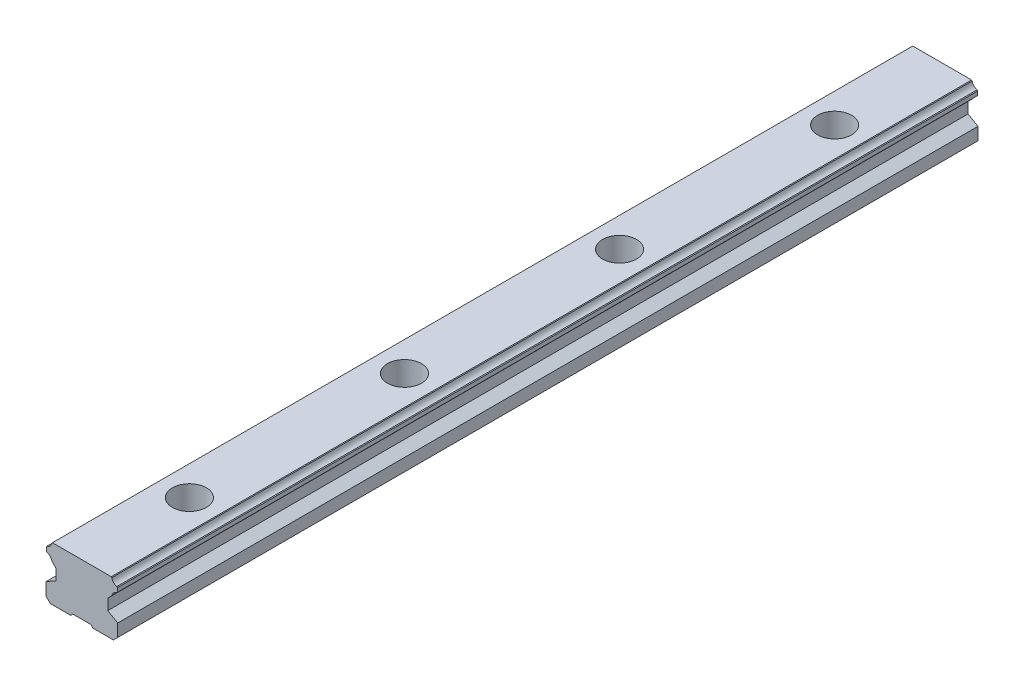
ISO-10303-21;
HEADER;
FILE_DESCRIPTION(('STEP AP214'),'2;1');
FILE_NAME('part.step','',(''),(''),'','','');
FILE_SCHEMA(('AUTOMOTIVE_DESIGN { 1 0 10303 214 1 1 1 1 }'));
ENDSEC;
DATA;
#1=APPLICATION_CONTEXT('core data for automotive mechanical design processes');
#2=APPLICATION_PROTOCOL_DEFINITION('international standard','automotive_design',2000,#1);
#3=PRODUCT_CONTEXT('',#1,'mechanical');
#4=PRODUCT('Part','Part','',(#3));
#5=PRODUCT_RELATED_PRODUCT_CATEGORY('part','',(#4));
#6=PRODUCT_DEFINITION_FORMATION('','',#4);
#7=PRODUCT_DEFINITION_CONTEXT('part definition',#1,'design');
#8=PRODUCT_DEFINITION('design','',#6,#7);
#9=PRODUCT_DEFINITION_SHAPE('','',#8);
#10=(LENGTH_UNIT() NAMED_UNIT(*) SI_UNIT(.MILLI.,.METRE.));
#11=(NAMED_UNIT(*) PLANE_ANGLE_UNIT() SI_UNIT($,.RADIAN.));
#12=(NAMED_UNIT(*) SI_UNIT($,.STERADIAN.) SOLID_ANGLE_UNIT());
#13=UNCERTAINTY_MEASURE_WITH_UNIT(LENGTH_MEASURE(1.E-05),#10,'distance_accuracy_value','');
#14=(GEOMETRIC_REPRESENTATION_CONTEXT(3) GLOBAL_UNCERTAINTY_ASSIGNED_CONTEXT((#13)) GLOBAL_UNIT_ASSIGNED_CONTEXT((#10,
#11,#12)) REPRESENTATION_CONTEXT('',''));
#15=CARTESIAN_POINT('',(0.,0.,0.));
#16=DIRECTION('',(0.,0.,1.));
#17=DIRECTION('',(1.,0.,0.));
#18=AXIS2_PLACEMENT_3D('',#15,#16,#17);
#19=CARTESIAN_POINT('',(-2.500009,-27.400009,-151.658297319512));
#20=DIRECTION('',(0.,-1.,0.));
#21=DIRECTION('',(0.,0.,-1.));
#22=AXIS2_PLACEMENT_3D('',#19,#20,#21);
#23=PLANE('',#22);
#24=DIRECTION('',(0.,0.,-1.));
#25=VECTOR('',#24,1.);
#26=CARTESIAN_POINT('',(-2.50000899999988,-27.400009,-151.658298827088));
#27=LINE('',#26,#25);
#28=CARTESIAN_POINT('',(-2.50000899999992,-27.400009,-208.341701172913));
#29=VERTEX_POINT('',#28);
#30=CARTESIAN_POINT('',(-2.50000899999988,-27.400009,-151.658298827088));
#31=VERTEX_POINT('',#30);
#32=EDGE_CURVE('E265',#29,#31,#27,.F.);
#33=ORIENTED_EDGE('',*,*,#32,.F.);
#34=CARTESIAN_POINT('',(0.,-27.400009,-210.));
#35=DIRECTION('',(0.,1.,0.));
#36=DIRECTION('',(0.,0.,1.));
#37=AXIS2_PLACEMENT_3D('',#34,#35,#36);
#38=CIRCLE('',#37,3.);
#39=CARTESIAN_POINT('',(2.50000999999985,-27.400009,-208.341702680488));
#40=VERTEX_POINT('',#39);
#41=EDGE_CURVE('E252',#29,#40,#38,.T.);
#42=ORIENTED_EDGE('',*,*,#41,.T.);
#43=DIRECTION('',(0.,0.,1.));
#44=VECTOR('',#43,1.);
#45=CARTESIAN_POINT('',(2.50000999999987,-27.400009,-208.341702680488));
#46=LINE('',#45,#44);
#47=CARTESIAN_POINT('',(2.50000999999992,-27.400009,-151.658297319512));
#48=VERTEX_POINT('',#47);
#49=EDGE_CURVE('E264',#40,#48,#46,.T.);
#50=ORIENTED_EDGE('',*,*,#49,.T.);
#51=CARTESIAN_POINT('',(0.,-27.400009,-150.));
#52=DIRECTION('',(0.,1.,0.));
#53=DIRECTION('',(0.,0.,-1.));
#54=AXIS2_PLACEMENT_3D('',#51,#52,#53);
#55=CIRCLE('',#54,3.);
#56=EDGE_CURVE('E280',#48,#31,#55,.T.);
#57=ORIENTED_EDGE('',*,*,#56,.T.);
#58=EDGE_LOOP('',(#33,#42,#50,#57));
#59=FACE_BOUND('',#58,.T.);
#60=ADVANCED_FACE('F16',(#59),#23,.T.);
#61=CARTESIAN_POINT('',(-2.500009,-27.400009,-91.6582973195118));
#62=DIRECTION('',(0.,-1.,0.));
#63=DIRECTION('',(0.,0.,-1.));
#64=AXIS2_PLACEMENT_3D('',#61,#62,#63);
#65=PLANE('',#64);
#66=DIRECTION('',(0.,0.,-1.));
#67=VECTOR('',#66,1.);
#68=CARTESIAN_POINT('',(-2.50000899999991,-27.400009,-91.6582988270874));
#69=LINE('',#68,#67);
#70=CARTESIAN_POINT('',(-2.50000899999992,-27.400009,-148.341701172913));
#71=VERTEX_POINT('',#70);
#72=CARTESIAN_POINT('',(-2.50000899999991,-27.400009,-91.6582988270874));
#73=VERTEX_POINT('',#72);
#74=EDGE_CURVE('E291',#71,#73,#69,.F.);
#75=ORIENTED_EDGE('',*,*,#74,.F.);
#76=CARTESIAN_POINT('',(0.,-27.400009,-150.));
#77=DIRECTION('',(0.,1.,0.));
#78=DIRECTION('',(0.,0.,1.));
#79=AXIS2_PLACEMENT_3D('',#76,#77,#78);
#80=CIRCLE('',#79,3.);
#81=CARTESIAN_POINT('',(2.50000999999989,-27.400009,-148.341702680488));
#82=VERTEX_POINT('',#81);
#83=EDGE_CURVE('E296',#71,#82,#80,.T.);
#84=ORIENTED_EDGE('',*,*,#83,.T.);
#85=DIRECTION('',(0.,0.,1.));
#86=VECTOR('',#85,1.);
#87=CARTESIAN_POINT('',(2.50000999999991,-27.400009,-148.341702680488));
#88=LINE('',#87,#86);
#89=CARTESIAN_POINT('',(2.50000999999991,-27.400009,-91.6582973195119));
#90=VERTEX_POINT('',#89);
#91=EDGE_CURVE('E301',#82,#90,#88,.T.);
#92=ORIENTED_EDGE('',*,*,#91,.T.);
#93=CARTESIAN_POINT('',(0.,-27.400009,-90.));
#94=DIRECTION('',(0.,1.,0.));
#95=DIRECTION('',(0.,0.,-1.));
#96=AXIS2_PLACEMENT_3D('',#93,#94,#95);
#97=CIRCLE('',#96,3.);
#98=EDGE_CURVE('E306',#90,#73,#97,.T.);
#99=ORIENTED_EDGE('',*,*,#98,.T.);
#100=EDGE_LOOP('',(#75,#84,#92,#99));
#101=FACE_BOUND('',#100,.T.);
#102=ADVANCED_FACE('F939',(#101),#65,.T.);
#103=CARTESIAN_POINT('',(-2.50000900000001,-27.400009,-31.6582973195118));
#104=DIRECTION('',(0.,-1.,0.));
#105=DIRECTION('',(0.,0.,-1.));
#106=AXIS2_PLACEMENT_3D('',#103,#104,#105);
#107=PLANE('',#106);
#108=DIRECTION('',(0.,0.,-1.));
#109=VECTOR('',#108,1.);
#110=CARTESIAN_POINT('',(-2.50000899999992,-27.400009,-31.6582988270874));
#111=LINE('',#110,#109);
#112=CARTESIAN_POINT('',(-2.50000899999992,-27.400009,-88.3417011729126));
#113=VERTEX_POINT('',#112);
#114=CARTESIAN_POINT('',(-2.50000899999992,-27.400009,-31.6582988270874));
#115=VERTEX_POINT('',#114);
#116=EDGE_CURVE('E311',#113,#115,#111,.F.);
#117=ORIENTED_EDGE('',*,*,#116,.F.);
#118=CARTESIAN_POINT('',(0.,-27.400009,-90.));
#119=DIRECTION('',(0.,1.,0.));
#120=DIRECTION('',(0.,0.,1.));
#121=AXIS2_PLACEMENT_3D('',#118,#119,#120);
#122=CIRCLE('',#121,3.);
#123=CARTESIAN_POINT('',(2.50000999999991,-27.400009,-88.3417026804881));
#124=VERTEX_POINT('',#123);
#125=EDGE_CURVE('E316',#113,#124,#122,.T.);
#126=ORIENTED_EDGE('',*,*,#125,.T.);
#127=DIRECTION('',(0.,0.,1.));
#128=VECTOR('',#127,1.);
#129=CARTESIAN_POINT('',(2.50000999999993,-27.400009,-88.3417026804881));
#130=LINE('',#129,#128);
#131=CARTESIAN_POINT('',(2.50000999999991,-27.400009,-31.658297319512));
#132=VERTEX_POINT('',#131);
#133=EDGE_CURVE('E321',#124,#132,#130,.T.);
#134=ORIENTED_EDGE('',*,*,#133,.T.);
#135=CARTESIAN_POINT('',(0.,-27.400009,-30.));
#136=DIRECTION('',(0.,1.,0.));
#137=DIRECTION('',(0.,0.,-1.));
#138=AXIS2_PLACEMENT_3D('',#135,#136,#137);
#139=CIRCLE('',#138,3.);
#140=EDGE_CURVE('E326',#132,#115,#139,.T.);
#141=ORIENTED_EDGE('',*,*,#140,.T.);
#142=EDGE_LOOP('',(#117,#126,#134,#141));
#143=FACE_BOUND('',#142,.T.);
#144=ADVANCED_FACE('F944',(#143),#107,.T.);
#145=CARTESIAN_POINT('',(-2.50000900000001,-27.400009,0.));
#146=DIRECTION('',(0.,-1.,0.));
#147=DIRECTION('',(0.,0.,-1.));
#148=AXIS2_PLACEMENT_3D('',#145,#146,#147);
#149=PLANE('',#148);
#150=DIRECTION('',(0.,0.,-1.));
#151=VECTOR('',#150,1.);
#152=CARTESIAN_POINT('',(-2.500009,-27.400009,0.));
#153=LINE('',#152,#151);
#154=CARTESIAN_POINT('',(-2.50000899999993,-27.400009,-28.3417011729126));
#155=VERTEX_POINT('',#154);
#156=CARTESIAN_POINT('',(-2.500009,-27.400009,0.));
#157=VERTEX_POINT('',#156);
#158=EDGE_CURVE('E331',#155,#157,#153,.F.);
#159=ORIENTED_EDGE('',*,*,#158,.F.);
#160=CARTESIAN_POINT('',(0.,-27.400009,-30.));
#161=DIRECTION('',(0.,1.,0.));
#162=DIRECTION('',(0.,0.,1.));
#163=AXIS2_PLACEMENT_3D('',#160,#161,#162);
#164=CIRCLE('',#163,3.);
#165=CARTESIAN_POINT('',(2.50000999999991,-27.400009,-28.3417026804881));
#166=VERTEX_POINT('',#165);
#167=EDGE_CURVE('E336',#155,#166,#164,.T.);
#168=ORIENTED_EDGE('',*,*,#167,.T.);
#169=DIRECTION('',(0.,0.,1.));
#170=VECTOR('',#169,1.);
#171=CARTESIAN_POINT('',(2.50000999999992,-27.400009,-28.3417026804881));
#172=LINE('',#171,#170);
#173=CARTESIAN_POINT('',(2.50001,-27.400009,0.));
#174=VERTEX_POINT('',#173);
#175=EDGE_CURVE('E341',#166,#174,#172,.T.);
#176=ORIENTED_EDGE('',*,*,#175,.T.);
#177=DIRECTION('',(-1.,0.,0.));
#178=VECTOR('',#177,1.);
#179=CARTESIAN_POINT('',(2.50001,-27.400009,0.));
#180=LINE('',#179,#178);
#181=EDGE_CURVE('E346',#157,#174,#180,.F.);
#182=ORIENTED_EDGE('',*,*,#181,.F.);
#183=EDGE_LOOP('',(#159,#168,#176,#182));
#184=FACE_BOUND('',#183,.T.);
#185=ADVANCED_FACE('F950',(#184),#149,.T.);
#186=CARTESIAN_POINT('',(-10.,-26.8,-240.));
#187=DIRECTION('',(-1.,0.,0.));
#188=DIRECTION('',(0.,0.,1.));
#189=AXIS2_PLACEMENT_3D('',#186,#187,#188);
#190=PLANE('',#189);
#191=DIRECTION('',(0.,1.,0.));
#192=VECTOR('',#191,1.);
#193=CARTESIAN_POINT('',(-10.,-26.8,0.));
#194=LINE('',#193,#192);
#195=CARTESIAN_POINT('',(-10.,-23.3,0.));
#196=VERTEX_POINT('',#195);
#197=CARTESIAN_POINT('',(-10.,-26.8,0.));
#198=VERTEX_POINT('',#197);
#199=EDGE_CURVE('E350',#196,#198,#194,.F.);
#200=ORIENTED_EDGE('',*,*,#199,.F.);
#201=DIRECTION('',(0.,0.,-1.));
#202=VECTOR('',#201,1.);
#203=CARTESIAN_POINT('',(-10.,-23.3,0.));
#204=LINE('',#203,#202);
#205=CARTESIAN_POINT('',(-10.,-23.3,-240.));
#206=VERTEX_POINT('',#205);
#207=EDGE_CURVE('E354',#206,#196,#204,.F.);
#208=ORIENTED_EDGE('',*,*,#207,.F.);
#209=DIRECTION('',(0.,-1.,0.));
#210=VECTOR('',#209,1.);
#211=CARTESIAN_POINT('',(-10.,-23.3,-240.));
#212=LINE('',#211,#210);
#213=CARTESIAN_POINT('',(-10.,-26.8,-240.));
#214=VERTEX_POINT('',#213);
#215=EDGE_CURVE('E359',#206,#214,#212,.T.);
#216=ORIENTED_EDGE('',*,*,#215,.T.);
#217=DIRECTION('',(0.,0.,1.));
#218=VECTOR('',#217,1.);
#219=CARTESIAN_POINT('',(-10.,-26.8,-240.));
#220=LINE('',#219,#218);
#221=EDGE_CURVE('E364',#214,#198,#220,.T.);
#222=ORIENTED_EDGE('',*,*,#221,.T.);
#223=EDGE_LOOP('',(#200,#208,#216,#222));
#224=FACE_BOUND('',#223,.T.);
#225=ADVANCED_FACE('F954',(#224),#190,.T.);
#226=CARTESIAN_POINT('',(-10.,-26.8,-240.));
#227=DIRECTION('',(-0.707106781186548,-0.707106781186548,0.));
#228=DIRECTION('',(0.707106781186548,-0.707106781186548,0.));
#229=AXIS2_PLACEMENT_3D('',#226,#227,#228);
#230=PLANE('',#229);
#231=DIRECTION('',(-0.707106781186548,0.707106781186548,0.));
#232=VECTOR('',#231,1.);
#233=CARTESIAN_POINT('',(-8.8,-28.,0.));
#234=LINE('',#233,#232);
#235=CARTESIAN_POINT('',(-8.8,-28.,0.));
#236=VERTEX_POINT('',#235);
#237=EDGE_CURVE('E369',#198,#236,#234,.F.);
#238=ORIENTED_EDGE('',*,*,#237,.F.);
#239=ORIENTED_EDGE('',*,*,#221,.F.);
#240=DIRECTION('',(0.707106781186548,-0.707106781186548,0.));
#241=VECTOR('',#240,1.);
#242=CARTESIAN_POINT('',(-10.,-26.8,-240.));
#243=LINE('',#242,#241);
#244=CARTESIAN_POINT('',(-8.8,-28.,-240.));
#245=VERTEX_POINT('',#244);
#246=EDGE_CURVE('E373',#214,#245,#243,.T.);
#247=ORIENTED_EDGE('',*,*,#246,.T.);
#248=DIRECTION('',(0.,0.,1.));
#249=VECTOR('',#248,1.);
#250=CARTESIAN_POINT('',(-8.8,-28.,-240.));
#251=LINE('',#250,#249);
#252=EDGE_CURVE('E378',#245,#236,#251,.T.);
#253=ORIENTED_EDGE('',*,*,#252,.T.);
#254=EDGE_LOOP('',(#238,#239,#247,#253));
#255=FACE_BOUND('',#254,.T.);
#256=ADVANCED_FACE('F958',(#255),#230,.T.);
#257=CARTESIAN_POINT('',(-8.8,-28.,0.));
#258=DIRECTION('',(0.,-1.,0.));
#259=DIRECTION('',(0.,0.,-1.));
#260=AXIS2_PLACEMENT_3D('',#257,#258,#259);
#261=PLANE('',#260);
#262=DIRECTION('',(-1.,0.,0.));
#263=VECTOR('',#262,1.);
#264=CARTESIAN_POINT('',(-3.1,-28.,0.));
#265=LINE('',#264,#263);
#266=CARTESIAN_POINT('',(-3.1,-28.,0.));
#267=VERTEX_POINT('',#266);
#268=EDGE_CURVE('E383',#236,#267,#265,.F.);
#269=ORIENTED_EDGE('',*,*,#268,.F.);
#270=ORIENTED_EDGE('',*,*,#252,.F.);
#271=DIRECTION('',(1.,0.,0.));
#272=VECTOR('',#271,1.);
#273=CARTESIAN_POINT('',(-8.8,-28.,-240.));
#274=LINE('',#273,#272);
#275=CARTESIAN_POINT('',(-3.1,-28.,-240.));
#276=VERTEX_POINT('',#275);
#277=EDGE_CURVE('E387',#245,#276,#274,.T.);
#278=ORIENTED_EDGE('',*,*,#277,.T.);
#279=DIRECTION('',(0.,0.,1.));
#280=VECTOR('',#279,1.);
#281=CARTESIAN_POINT('',(-3.1,-28.,-240.));
#282=LINE('',#281,#280);
#283=EDGE_CURVE('E392',#276,#267,#282,.T.);
#284=ORIENTED_EDGE('',*,*,#283,.T.);
#285=EDGE_LOOP('',(#269,#270,#278,#284));
#286=FACE_BOUND('',#285,.T.);
#287=ADVANCED_FACE('F403',(#286),#261,.T.);
#288=CARTESIAN_POINT('',(-3.1,-28.,-240.));
#289=DIRECTION('',(0.707106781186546,-0.707106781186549,0.));
#290=DIRECTION('',(0.707106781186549,0.707106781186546,0.));
#291=AXIS2_PLACEMENT_3D('',#288,#289,#290);
#292=PLANE('',#291);
#293=DIRECTION('',(0.,0.,1.));
#294=VECTOR('',#293,1.);
#295=CARTESIAN_POINT('',(-2.500009,-27.400009,-240.));
#296=LINE('',#295,#294);
#297=CARTESIAN_POINT('',(-2.500009,-27.400009,-240.));
#298=VERTEX_POINT('',#297);
#299=CARTESIAN_POINT('',(-2.50000899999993,-27.4000089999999,-211.658298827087));
#300=VERTEX_POINT('',#299);
#301=EDGE_CURVE('E275',#298,#300,#296,.T.);
#302=ORIENTED_EDGE('',*,*,#301,.T.);
#303=CARTESIAN_POINT('',(-2.50000899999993,-27.4000089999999,-211.658298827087));
#304=CARTESIAN_POINT('',(-2.56223329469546,-27.4622332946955,-211.564491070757));
#305=CARTESIAN_POINT('',(-2.61993099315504,-27.519930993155,-211.466429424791));
#306=CARTESIAN_POINT('',(-2.74821137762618,-27.6482113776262,-211.215318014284));
#307=CARTESIAN_POINT('',(-2.81549515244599,-27.715495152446,-211.054365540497));
#308=CARTESIAN_POINT('',(-2.89745692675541,-27.7974569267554,-210.782526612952));
#309=CARTESIAN_POINT('',(-2.91956109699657,-27.8195610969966,-210.696689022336));
#310=CARTESIAN_POINT('',(-2.94966381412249,-27.8496638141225,-210.550980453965));
#311=CARTESIAN_POINT('',(-2.95950297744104,-27.859502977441,-210.49578085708));
#312=CARTESIAN_POINT('',(-2.97660908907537,-27.8766090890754,-210.380098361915));
#313=CARTESIAN_POINT('',(-2.98424372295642,-27.8842437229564,-210.319744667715));
#314=CARTESIAN_POINT('',(-2.99255949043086,-27.8925594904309,-210.213865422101));
#315=CARTESIAN_POINT('',(-2.99413661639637,-27.8941366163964,-210.190480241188));
#316=CARTESIAN_POINT('',(-2.99674012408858,-27.8967401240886,-210.142868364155));
#317=CARTESIAN_POINT('',(-2.99783803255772,-27.8978380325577,-210.119584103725));
#318=CARTESIAN_POINT('',(-2.99902027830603,-27.899020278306,-210.077906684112));
#319=CARTESIAN_POINT('',(-2.99923432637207,-27.8992343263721,-210.069101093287));
#320=CARTESIAN_POINT('',(-2.9995816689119,-27.8995816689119,-210.051325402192));
#321=CARTESIAN_POINT('',(-2.99972506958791,-27.8997250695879,-210.042779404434));
#322=CARTESIAN_POINT('',(-2.99990176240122,-27.8999017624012,-210.025179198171));
#323=CARTESIAN_POINT('',(-2.99994596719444,-27.8999459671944,-210.020813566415));
#324=CARTESIAN_POINT('',(-2.99998976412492,-27.8999897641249,-210.008296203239));
#325=CARTESIAN_POINT('',(-2.99999530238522,-27.8999953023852,-210.005928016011));
#326=CARTESIAN_POINT('',(-2.99999970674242,-27.8999997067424,-210.002487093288));
#327=CARTESIAN_POINT('',(-3.00000052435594,-27.9000005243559,-210.001358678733));
#328=CARTESIAN_POINT('',(-3.00000117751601,-27.900001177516,-209.998029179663));
#329=CARTESIAN_POINT('',(-2.99999921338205,-27.899999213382,-209.995883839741));
#330=CARTESIAN_POINT('',(-2.99998733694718,-27.8999873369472,-209.98967132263));
#331=CARTESIAN_POINT('',(-2.99997144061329,-27.8999714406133,-209.985827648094));
#332=CARTESIAN_POINT('',(-2.99991469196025,-27.8999146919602,-209.976080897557));
#333=CARTESIAN_POINT('',(-2.99986406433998,-27.89986406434,-209.970795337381));
#334=CARTESIAN_POINT('',(-2.99958421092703,-27.899584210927,-209.945252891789));
#335=CARTESIAN_POINT('',(-2.99932928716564,-27.8993292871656,-209.934718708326));
#336=CARTESIAN_POINT('',(-2.9981929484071,-27.8981929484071,-209.890066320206));
#337=CARTESIAN_POINT('',(-2.99723122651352,-27.8972312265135,-209.868200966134));
#338=CARTESIAN_POINT('',(-2.99345588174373,-27.8934558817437,-209.793562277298));
#339=CARTESIAN_POINT('',(-2.99032180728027,-27.8903218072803,-209.754693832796));
#340=CARTESIAN_POINT('',(-2.98014256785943,-27.8801425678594,-209.646718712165));
#341=CARTESIAN_POINT('',(-2.97240954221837,-27.8724095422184,-209.588715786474));
#342=CARTESIAN_POINT('',(-2.94281881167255,-27.8428188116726,-209.401129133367));
#343=CARTESIAN_POINT('',(-2.91841288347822,-27.8184128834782,-209.29721355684));
#344=CARTESIAN_POINT('',(-2.85806613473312,-27.7580661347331,-209.080167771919));
#345=CARTESIAN_POINT('',(-2.81987333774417,-27.7198733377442,-208.969341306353));
#346=CARTESIAN_POINT('',(-2.69783570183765,-27.5978357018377,-208.670744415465));
#347=CARTESIAN_POINT('',(-2.60470423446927,-27.5047042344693,-208.499537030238));
#348=CARTESIAN_POINT('',(-2.50000899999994,-27.4000089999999,-208.341701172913));
#349=B_SPLINE_CURVE_WITH_KNOTS('',3,(#303,#304,#305,#306,#307,#308,#309,#310,#311,#312,#313,
#314,#315,#316,#317,#318,#319,#320,#321,#322,#323,#324,#325,#326,#327,#328,#329,#330,#331,#332,
#333,#334,#335,#336,#337,#338,#339,#340,#341,#342,#343,#344,#345,#346,#347,#348),.UNSPECIFIED.,
.F.,.F.,(4,2,2,2,2,2,2,2,2,2,2,2,2,2,2,2,2,2,2,2,2,2,4),(0.,0.0952525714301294,
0.232473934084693,0.293302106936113,0.32946322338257,0.366793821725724,0.377115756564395,
0.386696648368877,0.38920026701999,0.391450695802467,0.392496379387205,0.39274985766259,
0.392876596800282,0.393130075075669,0.393637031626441,0.394524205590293,0.398833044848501,
0.410025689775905,0.437321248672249,0.487788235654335,0.606822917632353,0.747024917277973,1.),.UNSPECIFIED.);
#350=EDGE_CURVE('E255',#300,#29,#349,.T.);
#351=ORIENTED_EDGE('',*,*,#350,.T.);
#352=ORIENTED_EDGE('',*,*,#32,.T.);
#353=CARTESIAN_POINT('',(-2.50000899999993,-27.4000089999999,-151.658298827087));
#354=CARTESIAN_POINT('',(-2.56223329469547,-27.4622332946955,-151.564491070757));
#355=CARTESIAN_POINT('',(-2.61993099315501,-27.519930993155,-151.466429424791));
#356=CARTESIAN_POINT('',(-2.74821137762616,-27.6482113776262,-151.215318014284));
#357=CARTESIAN_POINT('',(-2.81549515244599,-27.715495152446,-151.054365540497));
#358=CARTESIAN_POINT('',(-2.89745692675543,-27.7974569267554,-150.782526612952));
#359=CARTESIAN_POINT('',(-2.91956109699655,-27.8195610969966,-150.696689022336));
#360=CARTESIAN_POINT('',(-2.9496638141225,-27.8496638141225,-150.550980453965));
#361=CARTESIAN_POINT('',(-2.95950297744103,-27.859502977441,-150.49578085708));
#362=CARTESIAN_POINT('',(-2.97660908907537,-27.8766090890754,-150.380098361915));
#363=CARTESIAN_POINT('',(-2.98424372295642,-27.8842437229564,-150.319744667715));
#364=CARTESIAN_POINT('',(-2.99255949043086,-27.8925594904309,-150.213865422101));
#365=CARTESIAN_POINT('',(-2.99413661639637,-27.8941366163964,-150.190480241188));
#366=CARTESIAN_POINT('',(-2.99674012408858,-27.8967401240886,-150.142868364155));
#367=CARTESIAN_POINT('',(-2.99783803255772,-27.8978380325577,-150.119584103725));
#368=CARTESIAN_POINT('',(-2.99902027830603,-27.899020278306,-150.077906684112));
#369=CARTESIAN_POINT('',(-2.99923432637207,-27.8992343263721,-150.069101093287));
#370=CARTESIAN_POINT('',(-2.9995816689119,-27.8995816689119,-150.051325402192));
#371=CARTESIAN_POINT('',(-2.99972506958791,-27.8997250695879,-150.042779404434));
#372=CARTESIAN_POINT('',(-2.99990176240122,-27.8999017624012,-150.025179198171));
#373=CARTESIAN_POINT('',(-2.99994596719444,-27.8999459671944,-150.020813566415));
#374=CARTESIAN_POINT('',(-2.99998976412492,-27.8999897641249,-150.008296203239));
#375=CARTESIAN_POINT('',(-2.99999530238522,-27.8999953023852,-150.005928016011));
#376=CARTESIAN_POINT('',(-2.99999970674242,-27.8999997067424,-150.002487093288));
#377=CARTESIAN_POINT('',(-3.00000052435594,-27.9000005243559,-150.001358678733));
#378=CARTESIAN_POINT('',(-3.00000117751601,-27.900001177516,-149.998029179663));
#379=CARTESIAN_POINT('',(-2.99999921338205,-27.8999992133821,-149.995883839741));
#380=CARTESIAN_POINT('',(-2.99998733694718,-27.8999873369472,-149.98967132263));
#381=CARTESIAN_POINT('',(-2.99997144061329,-27.8999714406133,-149.985827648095));
#382=CARTESIAN_POINT('',(-2.99991469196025,-27.8999146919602,-149.976080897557));
#383=CARTESIAN_POINT('',(-2.99986406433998,-27.89986406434,-149.970795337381));
#384=CARTESIAN_POINT('',(-2.99958421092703,-27.899584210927,-149.945252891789));
#385=CARTESIAN_POINT('',(-2.99932928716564,-27.8993292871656,-149.934718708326));
#386=CARTESIAN_POINT('',(-2.9981929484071,-27.8981929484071,-149.890066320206));
#387=CARTESIAN_POINT('',(-2.99723122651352,-27.8972312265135,-149.868200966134));
#388=CARTESIAN_POINT('',(-2.99345588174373,-27.8934558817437,-149.793562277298));
#389=CARTESIAN_POINT('',(-2.99032180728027,-27.8903218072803,-149.754693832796));
#390=CARTESIAN_POINT('',(-2.98014256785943,-27.8801425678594,-149.646718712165));
#391=CARTESIAN_POINT('',(-2.97240954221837,-27.8724095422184,-149.588715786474));
#392=CARTESIAN_POINT('',(-2.94281881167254,-27.8428188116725,-149.401129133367));
#393=CARTESIAN_POINT('',(-2.91841288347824,-27.8184128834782,-149.297213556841));
#394=CARTESIAN_POINT('',(-2.85806613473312,-27.7580661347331,-149.080167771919));
#395=CARTESIAN_POINT('',(-2.8198733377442,-27.7198733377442,-148.969341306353));
#396=CARTESIAN_POINT('',(-2.69783570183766,-27.5978357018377,-148.670744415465));
#397=CARTESIAN_POINT('',(-2.60470423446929,-27.5047042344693,-148.499537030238));
#398=CARTESIAN_POINT('',(-2.50000899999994,-27.4000089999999,-148.341701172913));
#399=B_SPLINE_CURVE_WITH_KNOTS('',3,(#353,#354,#355,#356,#357,#358,#359,#360,#361,#362,#363,
#364,#365,#366,#367,#368,#369,#370,#371,#372,#373,#374,#375,#376,#377,#378,#379,#380,#381,#382,
#383,#384,#385,#386,#387,#388,#389,#390,#391,#392,#393,#394,#395,#396,#397,#398),.UNSPECIFIED.,
.F.,.F.,(4,2,2,2,2,2,2,2,2,2,2,2,2,2,2,2,2,2,2,2,2,2,4),(0.,0.0952525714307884,
0.232473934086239,0.293302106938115,0.329463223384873,0.366793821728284,0.377115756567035,
0.386696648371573,0.389200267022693,0.391450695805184,0.392496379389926,0.392749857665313,
0.392876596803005,0.393130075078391,0.393637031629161,0.394524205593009,0.398833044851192,
0.410025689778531,0.437321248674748,0.487788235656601,0.606822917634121,0.747024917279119,1.),.UNSPECIFIED.);
#400=EDGE_CURVE('E276',#31,#71,#399,.T.);
#401=ORIENTED_EDGE('',*,*,#400,.T.);
#402=ORIENTED_EDGE('',*,*,#74,.T.);
#403=CARTESIAN_POINT('',(-2.50000899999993,-27.4000089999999,-91.6582988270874));
#404=CARTESIAN_POINT('',(-2.56223329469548,-27.4622332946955,-91.564491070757));
#405=CARTESIAN_POINT('',(-2.61993099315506,-27.5199309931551,-91.4664294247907));
#406=CARTESIAN_POINT('',(-2.7482113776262,-27.6482113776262,-91.2153180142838));
#407=CARTESIAN_POINT('',(-2.81549515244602,-27.715495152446,-91.0543655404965));
#408=CARTESIAN_POINT('',(-2.89745692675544,-27.7974569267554,-90.7825266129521));
#409=CARTESIAN_POINT('',(-2.91956109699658,-27.8195610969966,-90.6966890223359));
#410=CARTESIAN_POINT('',(-2.94966381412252,-27.8496638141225,-90.5509804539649));
#411=CARTESIAN_POINT('',(-2.95950297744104,-27.859502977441,-90.4957808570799));
#412=CARTESIAN_POINT('',(-2.97660908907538,-27.8766090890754,-90.380098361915));
#413=CARTESIAN_POINT('',(-2.98424372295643,-27.8842437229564,-90.3197446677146));
#414=CARTESIAN_POINT('',(-2.99255949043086,-27.8925594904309,-90.2138654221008));
#415=CARTESIAN_POINT('',(-2.99413661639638,-27.8941366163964,-90.1904802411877));
#416=CARTESIAN_POINT('',(-2.99674012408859,-27.8967401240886,-90.1428683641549));
#417=CARTESIAN_POINT('',(-2.99783803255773,-27.8978380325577,-90.1195841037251));
#418=CARTESIAN_POINT('',(-2.99902027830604,-27.899020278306,-90.0779066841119));
#419=CARTESIAN_POINT('',(-2.99923432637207,-27.8992343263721,-90.0691010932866));
#420=CARTESIAN_POINT('',(-2.9995816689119,-27.8995816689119,-90.0513254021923));
#421=CARTESIAN_POINT('',(-2.99972506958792,-27.8997250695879,-90.0427794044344));
#422=CARTESIAN_POINT('',(-2.99990176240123,-27.8999017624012,-90.0251791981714));
#423=CARTESIAN_POINT('',(-2.99994596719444,-27.8999459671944,-90.0208135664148));
#424=CARTESIAN_POINT('',(-2.99998976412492,-27.8999897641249,-90.0082962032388));
#425=CARTESIAN_POINT('',(-2.99999530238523,-27.8999953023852,-90.005928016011));
#426=CARTESIAN_POINT('',(-2.99999970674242,-27.8999997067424,-90.0024870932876));
#427=CARTESIAN_POINT('',(-3.00000052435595,-27.9000005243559,-90.0013586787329));
#428=CARTESIAN_POINT('',(-3.00000117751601,-27.900001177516,-89.9980291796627));
#429=CARTESIAN_POINT('',(-2.99999921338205,-27.8999992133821,-89.9958838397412));
#430=CARTESIAN_POINT('',(-2.99998733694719,-27.8999873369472,-89.9896713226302));
#431=CARTESIAN_POINT('',(-2.99997144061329,-27.8999714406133,-89.9858276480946));
#432=CARTESIAN_POINT('',(-2.99991469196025,-27.8999146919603,-89.9760808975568));
#433=CARTESIAN_POINT('',(-2.99986406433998,-27.89986406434,-89.9707953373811));
#434=CARTESIAN_POINT('',(-2.99958421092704,-27.899584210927,-89.9452528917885));
#435=CARTESIAN_POINT('',(-2.99932928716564,-27.8993292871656,-89.9347187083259));
#436=CARTESIAN_POINT('',(-2.99819294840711,-27.8981929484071,-89.8900663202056));
#437=CARTESIAN_POINT('',(-2.99723122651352,-27.8972312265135,-89.8682009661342));
#438=CARTESIAN_POINT('',(-2.99345588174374,-27.8934558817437,-89.7935622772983));
#439=CARTESIAN_POINT('',(-2.99032180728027,-27.8903218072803,-89.7546938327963));
#440=CARTESIAN_POINT('',(-2.98014256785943,-27.8801425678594,-89.6467187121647));
#441=CARTESIAN_POINT('',(-2.97240954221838,-27.8724095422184,-89.5887157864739));
#442=CARTESIAN_POINT('',(-2.94281881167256,-27.8428188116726,-89.4011291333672));
#443=CARTESIAN_POINT('',(-2.91841288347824,-27.8184128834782,-89.2972135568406));
#444=CARTESIAN_POINT('',(-2.85806613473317,-27.7580661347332,-89.0801677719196));
#445=CARTESIAN_POINT('',(-2.81987333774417,-27.7198733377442,-88.9693413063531));
#446=CARTESIAN_POINT('',(-2.69783570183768,-27.5978357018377,-88.6707444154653));
#447=CARTESIAN_POINT('',(-2.6047042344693,-27.5047042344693,-88.4995370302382));
#448=CARTESIAN_POINT('',(-2.50000899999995,-27.4000089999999,-88.3417011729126));
#449=B_SPLINE_CURVE_WITH_KNOTS('',3,(#403,#404,#405,#406,#407,#408,#409,#410,#411,#412,#413,
#414,#415,#416,#417,#418,#419,#420,#421,#422,#423,#424,#425,#426,#427,#428,#429,#430,#431,#432,
#433,#434,#435,#436,#437,#438,#439,#440,#441,#442,#443,#444,#445,#446,#447,#448),.UNSPECIFIED.,
.F.,.F.,(4,2,2,2,2,2,2,2,2,2,2,2,2,2,2,2,2,2,2,2,2,2,4),(0.,0.095252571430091,0.232473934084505,
0.293302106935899,0.329463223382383,0.366793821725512,0.377115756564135,0.386696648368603,
0.389200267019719,0.391450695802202,0.39249637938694,0.392749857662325,0.392876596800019,
0.393130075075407,0.393637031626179,0.394524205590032,0.398833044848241,0.410025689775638,
0.437321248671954,0.487788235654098,0.606822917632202,0.747024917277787,1.),.UNSPECIFIED.);
#450=EDGE_CURVE('E415',#73,#113,#449,.T.);
#451=ORIENTED_EDGE('',*,*,#450,.T.);
#452=ORIENTED_EDGE('',*,*,#116,.T.);
#453=CARTESIAN_POINT('',(-2.50000899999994,-27.4000089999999,-31.6582988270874));
#454=CARTESIAN_POINT('',(-2.56223329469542,-27.4622332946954,-31.564491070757));
#455=CARTESIAN_POINT('',(-2.61993099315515,-27.5199309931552,-31.4664294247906));
#456=CARTESIAN_POINT('',(-2.7482113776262,-27.6482113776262,-31.2153180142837));
#457=CARTESIAN_POINT('',(-2.81549515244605,-27.7154951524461,-31.0543655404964));
#458=CARTESIAN_POINT('',(-2.89745692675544,-27.7974569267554,-30.7825266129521));
#459=CARTESIAN_POINT('',(-2.91956109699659,-27.8195610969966,-30.6966890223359));
#460=CARTESIAN_POINT('',(-2.94966381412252,-27.8496638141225,-30.5509804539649));
#461=CARTESIAN_POINT('',(-2.95950297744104,-27.859502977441,-30.49578085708));
#462=CARTESIAN_POINT('',(-2.97660908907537,-27.8766090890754,-30.3800983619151));
#463=CARTESIAN_POINT('',(-2.98424372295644,-27.8842437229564,-30.3197446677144));
#464=CARTESIAN_POINT('',(-2.99255949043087,-27.8925594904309,-30.2138654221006));
#465=CARTESIAN_POINT('',(-2.99413661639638,-27.8941366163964,-30.1904802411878));
#466=CARTESIAN_POINT('',(-2.99674012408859,-27.8967401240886,-30.1428683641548));
#467=CARTESIAN_POINT('',(-2.99783803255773,-27.8978380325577,-30.1195841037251));
#468=CARTESIAN_POINT('',(-2.99902027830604,-27.899020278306,-30.0779066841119));
#469=CARTESIAN_POINT('',(-2.99923432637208,-27.8992343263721,-30.0691010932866));
#470=CARTESIAN_POINT('',(-2.99958166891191,-27.8995816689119,-30.0513254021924));
#471=CARTESIAN_POINT('',(-2.99972506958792,-27.8997250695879,-30.0427794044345));
#472=CARTESIAN_POINT('',(-2.99990176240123,-27.8999017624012,-30.0251791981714));
#473=CARTESIAN_POINT('',(-2.99994596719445,-27.8999459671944,-30.0208135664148));
#474=CARTESIAN_POINT('',(-2.99998976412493,-27.8999897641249,-30.0082962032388));
#475=CARTESIAN_POINT('',(-2.99999530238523,-27.8999953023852,-30.005928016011));
#476=CARTESIAN_POINT('',(-2.99999970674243,-27.8999997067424,-30.0024870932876));
#477=CARTESIAN_POINT('',(-3.00000052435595,-27.900000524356,-30.0013586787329));
#478=CARTESIAN_POINT('',(-3.00000117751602,-27.900001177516,-29.9980291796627));
#479=CARTESIAN_POINT('',(-2.99999921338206,-27.8999992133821,-29.9958838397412));
#480=CARTESIAN_POINT('',(-2.99998733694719,-27.8999873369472,-29.9896713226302));
#481=CARTESIAN_POINT('',(-2.99997144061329,-27.8999714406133,-29.9858276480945));
#482=CARTESIAN_POINT('',(-2.99991469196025,-27.8999146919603,-29.9760808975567));
#483=CARTESIAN_POINT('',(-2.99986406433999,-27.89986406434,-29.970795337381));
#484=CARTESIAN_POINT('',(-2.99958421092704,-27.899584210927,-29.9452528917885));
#485=CARTESIAN_POINT('',(-2.99932928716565,-27.8993292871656,-29.9347187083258));
#486=CARTESIAN_POINT('',(-2.99819294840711,-27.8981929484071,-29.8900663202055));
#487=CARTESIAN_POINT('',(-2.99723122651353,-27.8972312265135,-29.8682009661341));
#488=CARTESIAN_POINT('',(-2.99345588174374,-27.8934558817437,-29.7935622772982));
#489=CARTESIAN_POINT('',(-2.99032180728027,-27.8903218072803,-29.7546938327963));
#490=CARTESIAN_POINT('',(-2.98014256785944,-27.8801425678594,-29.6467187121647));
#491=CARTESIAN_POINT('',(-2.97240954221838,-27.8724095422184,-29.5887157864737));
#492=CARTESIAN_POINT('',(-2.94281881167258,-27.8428188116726,-29.4011291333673));
#493=CARTESIAN_POINT('',(-2.91841288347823,-27.8184128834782,-29.2972135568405));
#494=CARTESIAN_POINT('',(-2.85806613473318,-27.7580661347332,-29.0801677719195));
#495=CARTESIAN_POINT('',(-2.81987333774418,-27.7198733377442,-28.9693413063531));
#496=CARTESIAN_POINT('',(-2.69783570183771,-27.5978357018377,-28.6707444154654));
#497=CARTESIAN_POINT('',(-2.60470423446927,-27.5047042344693,-28.4995370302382));
#498=CARTESIAN_POINT('',(-2.50000899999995,-27.400009,-28.3417011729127));
#499=B_SPLINE_CURVE_WITH_KNOTS('',3,(#453,#454,#455,#456,#457,#458,#459,#460,#461,#462,#463,
#464,#465,#466,#467,#468,#469,#470,#471,#472,#473,#474,#475,#476,#477,#478,#479,#480,#481,#482,
#483,#484,#485,#486,#487,#488,#489,#490,#491,#492,#493,#494,#495,#496,#497,#498),.UNSPECIFIED.,
.F.,.F.,(4,2,2,2,2,2,2,2,2,2,2,2,2,2,2,2,2,2,2,2,2,2,4),(0.,0.0952525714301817,
0.232473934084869,0.293302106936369,0.329463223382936,0.366793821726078,0.377115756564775,
0.386696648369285,0.389200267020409,0.391450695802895,0.392496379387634,0.392749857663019,
0.392876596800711,0.393130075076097,0.393637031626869,0.39452420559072,0.398833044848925,
0.410025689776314,0.437321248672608,0.487788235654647,0.606822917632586,0.747024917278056,1.),.UNSPECIFIED.);
#500=EDGE_CURVE('E411',#115,#155,#499,.T.);
#501=ORIENTED_EDGE('',*,*,#500,.T.);
#502=ORIENTED_EDGE('',*,*,#158,.T.);
#503=DIRECTION('',(-0.707106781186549,-0.707106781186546,0.));
#504=VECTOR('',#503,1.);
#505=CARTESIAN_POINT('',(-2.500009,-27.400009,0.));
#506=LINE('',#505,#504);
#507=EDGE_CURVE('E407',#267,#157,#506,.F.);
#508=ORIENTED_EDGE('',*,*,#507,.F.);
#509=ORIENTED_EDGE('',*,*,#283,.F.);
#510=DIRECTION('',(0.707106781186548,0.707106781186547,0.));
#511=VECTOR('',#510,1.);
#512=CARTESIAN_POINT('',(-3.1,-28.,-240.));
#513=LINE('',#512,#511);
#514=EDGE_CURVE('E406',#276,#298,#513,.T.);
#515=ORIENTED_EDGE('',*,*,#514,.T.);
#516=EDGE_LOOP('',(#302,#351,#352,#401,#402,#451,#452,#501,#502,#508,#509,#515));
#517=FACE_BOUND('',#516,.T.);
#518=ADVANCED_FACE('F271',(#517),#292,.T.);
#519=CARTESIAN_POINT('',(-2.500009,-27.400009,-211.658297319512));
#520=DIRECTION('',(0.,-1.,0.));
#521=DIRECTION('',(0.,0.,-1.));
#522=AXIS2_PLACEMENT_3D('',#519,#520,#521);
#523=PLANE('',#522);
#524=DIRECTION('',(0.,0.,1.));
#525=VECTOR('',#524,1.);
#526=CARTESIAN_POINT('',(2.50001,-27.400009,-240.));
#527=LINE('',#526,#525);
#528=CARTESIAN_POINT('',(2.50001,-27.400009,-240.));
#529=VERTEX_POINT('',#528);
#530=CARTESIAN_POINT('',(2.50000999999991,-27.400009,-211.658297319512));
#531=VERTEX_POINT('',#530);
#532=EDGE_CURVE('E413',#529,#531,#527,.T.);
#533=ORIENTED_EDGE('',*,*,#532,.T.);
#534=CARTESIAN_POINT('',(0.,-27.400009,-210.));
#535=DIRECTION('',(0.,1.,0.));
#536=DIRECTION('',(0.,0.,-1.));
#537=AXIS2_PLACEMENT_3D('',#534,#535,#536);
#538=CIRCLE('',#537,3.);
#539=EDGE_CURVE('E428',#531,#300,#538,.T.);
#540=ORIENTED_EDGE('',*,*,#539,.T.);
#541=ORIENTED_EDGE('',*,*,#301,.F.);
#542=DIRECTION('',(1.,0.,0.));
#543=VECTOR('',#542,1.);
#544=CARTESIAN_POINT('',(-2.500009,-27.400009,-240.));
#545=LINE('',#544,#543);
#546=EDGE_CURVE('E432',#298,#529,#545,.T.);
#547=ORIENTED_EDGE('',*,*,#546,.T.);
#548=EDGE_LOOP('',(#533,#540,#541,#547));
#549=FACE_BOUND('',#548,.T.);
#550=ADVANCED_FACE('F459',(#549),#523,.T.);
#551=CARTESIAN_POINT('',(2.50000999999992,-27.4000089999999,-240.));
#552=DIRECTION('',(-0.707107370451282,-0.707106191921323,0.));
#553=DIRECTION('',(0.707106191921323,-0.707107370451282,0.));
#554=AXIS2_PLACEMENT_3D('',#551,#552,#553);
#555=PLANE('',#554);
#556=ORIENTED_EDGE('',*,*,#49,.F.);
#557=CARTESIAN_POINT('',(2.50000999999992,-27.4000089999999,-208.341702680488));
#558=CARTESIAN_POINT('',(2.56223416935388,-27.4622332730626,-208.435510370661));
#559=CARTESIAN_POINT('',(2.61993175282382,-27.5199309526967,-208.533571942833));
#560=CARTESIAN_POINT('',(2.74821188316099,-27.6482112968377,-208.78468315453));
#561=CARTESIAN_POINT('',(2.81549552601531,-27.7154950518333,-208.945635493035));
#562=CARTESIAN_POINT('',(2.89745713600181,-27.7974567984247,-209.217474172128));
#563=CARTESIAN_POINT('',(2.91956126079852,-27.8195609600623,-209.303311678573));
#564=CARTESIAN_POINT('',(2.94966391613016,-27.8496636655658,-209.449020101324));
#565=CARTESIAN_POINT('',(2.95950305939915,-27.8595028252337,-209.504219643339));
#566=CARTESIAN_POINT('',(2.97660913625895,-27.8766089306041,-209.619902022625));
#567=CARTESIAN_POINT('',(2.98424375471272,-27.8842435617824,-209.680255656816));
#568=CARTESIAN_POINT('',(2.99255950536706,-27.8925593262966,-209.786134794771));
#569=CARTESIAN_POINT('',(2.9941366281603,-27.8941364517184,-209.809519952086));
#570=CARTESIAN_POINT('',(2.99674013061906,-27.8967399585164,-209.857131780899));
#571=CARTESIAN_POINT('',(2.99783803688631,-27.8978378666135,-209.880416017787));
#572=CARTESIAN_POINT('',(2.99902028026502,-27.8990201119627,-209.922093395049));
#573=CARTESIAN_POINT('',(2.9992343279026,-27.899234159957,-209.93089897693));
#574=CARTESIAN_POINT('',(2.99958166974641,-27.8995815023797,-209.948674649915));
#575=CARTESIAN_POINT('',(2.99972507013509,-27.8997249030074,-209.957220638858));
#576=CARTESIAN_POINT('',(2.99990176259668,-27.8999015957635,-209.974820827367));
#577=CARTESIAN_POINT('',(2.99994596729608,-27.8999458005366,-209.979186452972));
#578=CARTESIAN_POINT('',(2.99998976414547,-27.899989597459,-209.991703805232));
#579=CARTESIAN_POINT('',(2.99999530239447,-27.8999951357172,-209.994071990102));
#580=CARTESIAN_POINT('',(2.99999970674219,-27.8999995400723,-209.997512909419));
#581=CARTESIAN_POINT('',(3.0000005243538,-27.9000003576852,-209.99864132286));
#582=CARTESIAN_POINT('',(3.0000011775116,-27.9000010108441,-210.001970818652));
#583=CARTESIAN_POINT('',(2.99999921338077,-27.89999904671,-210.004116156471));
#584=CARTESIAN_POINT('',(2.99998733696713,-27.8999871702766,-210.010328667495));
#585=CARTESIAN_POINT('',(2.99997144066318,-27.8999712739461,-210.014172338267));
#586=CARTESIAN_POINT('',(2.99991469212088,-27.8999145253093,-210.023919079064));
#587=CARTESIAN_POINT('',(2.9998640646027,-27.8998638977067,-210.029204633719));
#588=CARTESIAN_POINT('',(2.99958421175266,-27.8995840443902,-210.054747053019));
#589=CARTESIAN_POINT('',(2.99932928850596,-27.8993291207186,-210.065281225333));
#590=CARTESIAN_POINT('',(2.99819295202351,-27.8981927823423,-210.109933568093));
#591=CARTESIAN_POINT('',(2.99723123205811,-27.897231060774,-210.131798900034));
#592=CARTESIAN_POINT('',(2.99345589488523,-27.8934557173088,-210.206437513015));
#593=CARTESIAN_POINT('',(2.99032182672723,-27.8903216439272,-210.245305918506));
#594=CARTESIAN_POINT('',(2.98014260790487,-27.8801424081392,-210.353280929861));
#595=CARTESIAN_POINT('',(2.9724095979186,-27.8724093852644,-210.41128379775));
#596=CARTESIAN_POINT('',(2.94281892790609,-27.8428186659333,-210.598870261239));
#597=CARTESIAN_POINT('',(2.91841304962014,-27.8184127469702,-210.702785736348));
#598=CARTESIAN_POINT('',(2.85806642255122,-27.7580660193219,-210.919831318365));
#599=CARTESIAN_POINT('',(2.81987370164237,-27.7198732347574,-211.030657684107));
#600=CARTESIAN_POINT('',(2.69783630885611,-27.5978356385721,-211.329254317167));
#601=CARTESIAN_POINT('',(2.60470502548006,-27.5047041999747,-211.500461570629));
#602=CARTESIAN_POINT('',(2.50000999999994,-27.4000089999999,-211.658297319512));
#603=B_SPLINE_CURVE_WITH_KNOTS('',3,(#557,#558,#559,#560,#561,#562,#563,#564,#565,#566,#567,
#568,#569,#570,#571,#572,#573,#574,#575,#576,#577,#578,#579,#580,#581,#582,#583,#584,#585,#586,
#587,#588,#589,#590,#591,#592,#593,#594,#595,#596,#597,#598,#599,#600,#601,#602),.UNSPECIFIED.,
.F.,.F.,(4,2,2,2,2,2,2,2,2,2,2,2,2,2,2,2,2,2,2,2,2,2,4),(0.,0.0952525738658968,0.23247394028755,
0.293302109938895,0.329463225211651,0.366793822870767,0.377115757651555,0.386696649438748,
0.389200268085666,0.391450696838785,0.392496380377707,0.392749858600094,0.392876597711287,
0.393130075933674,0.393637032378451,0.394524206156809,0.398833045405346,0.410025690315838,
0.437321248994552,0.487788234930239,0.606822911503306,0.747024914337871,1.),.UNSPECIFIED.);
#604=EDGE_CURVE('E258',#40,#531,#603,.T.);
#605=ORIENTED_EDGE('',*,*,#604,.T.);
#606=ORIENTED_EDGE('',*,*,#532,.F.);
#607=DIRECTION('',(0.707106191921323,-0.707107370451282,0.));
#608=VECTOR('',#607,1.);
#609=CARTESIAN_POINT('',(2.50001,-27.400009,-240.));
#610=LINE('',#609,#608);
#611=CARTESIAN_POINT('',(3.1,-28.,-240.));
#612=VERTEX_POINT('',#611);
#613=EDGE_CURVE('E446',#529,#612,#610,.T.);
#614=ORIENTED_EDGE('',*,*,#613,.T.);
#615=DIRECTION('',(0.,0.,1.));
#616=VECTOR('',#615,1.);
#617=CARTESIAN_POINT('',(3.1,-28.,-240.));
#618=LINE('',#617,#616);
#619=CARTESIAN_POINT('',(3.1,-28.,0.));
#620=VERTEX_POINT('',#619);
#621=EDGE_CURVE('E494',#612,#620,#618,.T.);
#622=ORIENTED_EDGE('',*,*,#621,.T.);
#623=DIRECTION('',(-0.707106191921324,0.70710737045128,0.));
#624=VECTOR('',#623,1.);
#625=CARTESIAN_POINT('',(3.1,-28.,0.));
#626=LINE('',#625,#624);
#627=EDGE_CURVE('E491',#174,#620,#626,.F.);
#628=ORIENTED_EDGE('',*,*,#627,.F.);
#629=ORIENTED_EDGE('',*,*,#175,.F.);
#630=CARTESIAN_POINT('',(2.50000999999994,-27.4000089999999,-28.341702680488));
#631=CARTESIAN_POINT('',(2.56223416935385,-27.4622332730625,-28.4355103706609));
#632=CARTESIAN_POINT('',(2.61993175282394,-27.5199309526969,-28.5335719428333));
#633=CARTESIAN_POINT('',(2.74821188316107,-27.6482112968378,-28.7846831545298));
#634=CARTESIAN_POINT('',(2.81549552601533,-27.7154950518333,-28.9456354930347));
#635=CARTESIAN_POINT('',(2.8974571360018,-27.7974567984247,-29.217474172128));
#636=CARTESIAN_POINT('',(2.91956126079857,-27.8195609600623,-29.3033116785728));
#637=CARTESIAN_POINT('',(2.94966391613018,-27.8496636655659,-29.4490201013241));
#638=CARTESIAN_POINT('',(2.95950305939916,-27.8595028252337,-29.5042196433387));
#639=CARTESIAN_POINT('',(2.97660913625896,-27.8766089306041,-29.6199020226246));
#640=CARTESIAN_POINT('',(2.98424375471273,-27.8842435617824,-29.6802556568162));
#641=CARTESIAN_POINT('',(2.99255950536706,-27.8925593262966,-29.7861347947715));
#642=CARTESIAN_POINT('',(2.99413662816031,-27.8941364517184,-29.8095199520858));
#643=CARTESIAN_POINT('',(2.99674013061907,-27.8967399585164,-29.8571317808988));
#644=CARTESIAN_POINT('',(2.99783803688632,-27.8978378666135,-29.880416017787));
#645=CARTESIAN_POINT('',(2.99902028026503,-27.8990201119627,-29.9220933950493));
#646=CARTESIAN_POINT('',(2.99923432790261,-27.899234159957,-29.9308989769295));
#647=CARTESIAN_POINT('',(2.99958166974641,-27.8995815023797,-29.9486746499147));
#648=CARTESIAN_POINT('',(2.9997250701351,-27.8997249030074,-29.9572206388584));
#649=CARTESIAN_POINT('',(2.99990176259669,-27.8999015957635,-29.9748208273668));
#650=CARTESIAN_POINT('',(2.99994596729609,-27.8999458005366,-29.9791864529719));
#651=CARTESIAN_POINT('',(2.99998976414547,-27.899989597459,-29.991703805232));
#652=CARTESIAN_POINT('',(2.99999530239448,-27.8999951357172,-29.9940719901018));
#653=CARTESIAN_POINT('',(2.9999997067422,-27.8999995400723,-29.9975129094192));
#654=CARTESIAN_POINT('',(3.00000052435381,-27.9000003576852,-29.9986413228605));
#655=CARTESIAN_POINT('',(3.00000117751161,-27.9000010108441,-30.0019708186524));
#656=CARTESIAN_POINT('',(2.99999921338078,-27.89999904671,-30.0041161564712));
#657=CARTESIAN_POINT('',(2.99998733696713,-27.8999871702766,-30.0103286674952));
#658=CARTESIAN_POINT('',(2.99997144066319,-27.8999712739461,-30.0141723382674));
#659=CARTESIAN_POINT('',(2.99991469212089,-27.8999145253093,-30.0239190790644));
#660=CARTESIAN_POINT('',(2.9998640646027,-27.8998638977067,-30.0292046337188));
#661=CARTESIAN_POINT('',(2.99958421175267,-27.8995840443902,-30.0547470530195));
#662=CARTESIAN_POINT('',(2.99932928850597,-27.8993291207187,-30.0652812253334));
#663=CARTESIAN_POINT('',(2.99819295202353,-27.8981927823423,-30.1099335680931));
#664=CARTESIAN_POINT('',(2.99723123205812,-27.897231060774,-30.1317989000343));
#665=CARTESIAN_POINT('',(2.99345589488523,-27.8934557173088,-30.2064375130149));
#666=CARTESIAN_POINT('',(2.99032182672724,-27.8903216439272,-30.2453059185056));
#667=CARTESIAN_POINT('',(2.98014260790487,-27.8801424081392,-30.3532809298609));
#668=CARTESIAN_POINT('',(2.97240959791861,-27.8724093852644,-30.4112837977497));
#669=CARTESIAN_POINT('',(2.94281892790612,-27.8428186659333,-30.5988702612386));
#670=CARTESIAN_POINT('',(2.91841304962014,-27.8184127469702,-30.7027857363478));
#671=CARTESIAN_POINT('',(2.85806642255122,-27.7580660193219,-30.919831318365));
#672=CARTESIAN_POINT('',(2.81987370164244,-27.7198732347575,-31.0306576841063));
#673=CARTESIAN_POINT('',(2.69783630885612,-27.5978356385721,-31.3292543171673));
#674=CARTESIAN_POINT('',(2.6047050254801,-27.5047041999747,-31.5004615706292));
#675=CARTESIAN_POINT('',(2.50000999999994,-27.4000089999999,-31.6582973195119));
#676=B_SPLINE_CURVE_WITH_KNOTS('',3,(#630,#631,#632,#633,#634,#635,#636,#637,#638,#639,#640,
#641,#642,#643,#644,#645,#646,#647,#648,#649,#650,#651,#652,#653,#654,#655,#656,#657,#658,#659,
#660,#661,#662,#663,#664,#665,#666,#667,#668,#669,#670,#671,#672,#673,#674,#675),.UNSPECIFIED.,
.F.,.F.,(4,2,2,2,2,2,2,2,2,2,2,2,2,2,2,2,2,2,2,2,2,2,4),(0.,0.0952525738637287,
0.232473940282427,0.293302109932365,0.329463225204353,0.366793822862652,0.377115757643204,
0.386696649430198,0.389200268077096,0.39145069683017,0.392496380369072,0.392749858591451,
0.392876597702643,0.393130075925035,0.393637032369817,0.394524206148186,0.398833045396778,
0.410025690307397,0.437321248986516,0.487788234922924,0.606822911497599,0.747024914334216,1.),.UNSPECIFIED.);
#677=EDGE_CURVE('E488',#166,#132,#676,.T.);
#678=ORIENTED_EDGE('',*,*,#677,.T.);
#679=ORIENTED_EDGE('',*,*,#133,.F.);
#680=CARTESIAN_POINT('',(2.50000999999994,-27.4000089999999,-88.3417026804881));
#681=CARTESIAN_POINT('',(2.56223416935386,-27.4622332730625,-88.435510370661));
#682=CARTESIAN_POINT('',(2.61993175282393,-27.5199309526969,-88.5335719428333));
#683=CARTESIAN_POINT('',(2.74821188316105,-27.6482112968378,-88.7846831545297));
#684=CARTESIAN_POINT('',(2.81549552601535,-27.7154950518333,-88.9456354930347));
#685=CARTESIAN_POINT('',(2.89745713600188,-27.7974567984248,-89.2174741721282));
#686=CARTESIAN_POINT('',(2.91956126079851,-27.8195609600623,-89.3033116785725));
#687=CARTESIAN_POINT('',(2.9496639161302,-27.8496636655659,-89.4490201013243));
#688=CARTESIAN_POINT('',(2.95950305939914,-27.8595028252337,-89.5042196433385));
#689=CARTESIAN_POINT('',(2.97660913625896,-27.8766089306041,-89.6199020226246));
#690=CARTESIAN_POINT('',(2.98424375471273,-27.8842435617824,-89.6802556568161));
#691=CARTESIAN_POINT('',(2.99255950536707,-27.8925593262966,-89.7861347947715));
#692=CARTESIAN_POINT('',(2.99413662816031,-27.8941364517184,-89.8095199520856));
#693=CARTESIAN_POINT('',(2.99674013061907,-27.8967399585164,-89.8571317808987));
#694=CARTESIAN_POINT('',(2.99783803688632,-27.8978378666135,-89.8804160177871));
#695=CARTESIAN_POINT('',(2.99902028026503,-27.8990201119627,-89.9220933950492));
#696=CARTESIAN_POINT('',(2.99923432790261,-27.899234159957,-89.9308989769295));
#697=CARTESIAN_POINT('',(2.99958166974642,-27.8995815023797,-89.9486746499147));
#698=CARTESIAN_POINT('',(2.9997250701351,-27.8997249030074,-89.9572206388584));
#699=CARTESIAN_POINT('',(2.99990176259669,-27.8999015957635,-89.9748208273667));
#700=CARTESIAN_POINT('',(2.99994596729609,-27.8999458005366,-89.9791864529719));
#701=CARTESIAN_POINT('',(2.99998976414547,-27.899989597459,-89.991703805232));
#702=CARTESIAN_POINT('',(2.99999530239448,-27.8999951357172,-89.9940719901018));
#703=CARTESIAN_POINT('',(2.9999997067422,-27.8999995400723,-89.9975129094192));
#704=CARTESIAN_POINT('',(3.00000052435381,-27.9000003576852,-89.9986413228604));
#705=CARTESIAN_POINT('',(3.00000117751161,-27.9000010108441,-90.0019708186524));
#706=CARTESIAN_POINT('',(2.99999921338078,-27.89999904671,-90.0041161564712));
#707=CARTESIAN_POINT('',(2.99998733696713,-27.8999871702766,-90.0103286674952));
#708=CARTESIAN_POINT('',(2.99997144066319,-27.8999712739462,-90.0141723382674));
#709=CARTESIAN_POINT('',(2.99991469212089,-27.8999145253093,-90.0239190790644));
#710=CARTESIAN_POINT('',(2.9998640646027,-27.8998638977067,-90.0292046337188));
#711=CARTESIAN_POINT('',(2.99958421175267,-27.8995840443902,-90.0547470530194));
#712=CARTESIAN_POINT('',(2.99932928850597,-27.8993291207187,-90.0652812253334));
#713=CARTESIAN_POINT('',(2.99819295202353,-27.8981927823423,-90.1099335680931));
#714=CARTESIAN_POINT('',(2.99723123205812,-27.897231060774,-90.1317989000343));
#715=CARTESIAN_POINT('',(2.99345589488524,-27.8934557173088,-90.2064375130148));
#716=CARTESIAN_POINT('',(2.99032182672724,-27.8903216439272,-90.2453059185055));
#717=CARTESIAN_POINT('',(2.98014260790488,-27.8801424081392,-90.3532809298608));
#718=CARTESIAN_POINT('',(2.97240959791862,-27.8724093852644,-90.4112837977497));
#719=CARTESIAN_POINT('',(2.94281892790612,-27.8428186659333,-90.5988702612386));
#720=CARTESIAN_POINT('',(2.91841304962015,-27.8184127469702,-90.7027857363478));
#721=CARTESIAN_POINT('',(2.85806642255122,-27.7580660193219,-90.919831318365));
#722=CARTESIAN_POINT('',(2.81987370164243,-27.7198732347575,-91.0306576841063));
#723=CARTESIAN_POINT('',(2.69783630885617,-27.5978356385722,-91.3292543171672));
#724=CARTESIAN_POINT('',(2.60470502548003,-27.5047041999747,-91.5004615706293));
#725=CARTESIAN_POINT('',(2.50000999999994,-27.4000089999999,-91.6582973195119));
#726=B_SPLINE_CURVE_WITH_KNOTS('',3,(#680,#681,#682,#683,#684,#685,#686,#687,#688,#689,#690,
#691,#692,#693,#694,#695,#696,#697,#698,#699,#700,#701,#702,#703,#704,#705,#706,#707,#708,#709,
#710,#711,#712,#713,#714,#715,#716,#717,#718,#719,#720,#721,#722,#723,#724,#725),.UNSPECIFIED.,
.F.,.F.,(4,2,2,2,2,2,2,2,2,2,2,2,2,2,2,2,2,2,2,2,2,2,4),(0.,0.0952525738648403,
0.232473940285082,0.293302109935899,0.329463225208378,0.366793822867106,0.377115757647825,
0.386696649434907,0.389200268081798,0.391450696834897,0.392496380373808,0.39274985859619,
0.392876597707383,0.393130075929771,0.39363703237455,0.394524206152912,0.398833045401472,
0.410025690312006,0.437321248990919,0.48778823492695,0.606822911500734,0.747024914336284,1.),.UNSPECIFIED.);
#727=EDGE_CURVE('E486',#124,#90,#726,.T.);
#728=ORIENTED_EDGE('',*,*,#727,.T.);
#729=ORIENTED_EDGE('',*,*,#91,.F.);
#730=CARTESIAN_POINT('',(2.50000999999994,-27.4000089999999,-148.341702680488));
#731=CARTESIAN_POINT('',(2.56223416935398,-27.4622332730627,-148.435510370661));
#732=CARTESIAN_POINT('',(2.61993175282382,-27.5199309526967,-148.533571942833));
#733=CARTESIAN_POINT('',(2.74821188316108,-27.6482112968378,-148.78468315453));
#734=CARTESIAN_POINT('',(2.81549552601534,-27.7154950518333,-148.945635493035));
#735=CARTESIAN_POINT('',(2.89745713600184,-27.7974567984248,-149.217474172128));
#736=CARTESIAN_POINT('',(2.91956126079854,-27.8195609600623,-149.303311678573));
#737=CARTESIAN_POINT('',(2.94966391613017,-27.8496636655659,-149.449020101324));
#738=CARTESIAN_POINT('',(2.95950305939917,-27.8595028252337,-149.504219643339));
#739=CARTESIAN_POINT('',(2.97660913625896,-27.8766089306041,-149.619902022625));
#740=CARTESIAN_POINT('',(2.98424375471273,-27.8842435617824,-149.680255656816));
#741=CARTESIAN_POINT('',(2.99255950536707,-27.8925593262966,-149.786134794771));
#742=CARTESIAN_POINT('',(2.99413662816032,-27.8941364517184,-149.809519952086));
#743=CARTESIAN_POINT('',(2.99674013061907,-27.8967399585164,-149.857131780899));
#744=CARTESIAN_POINT('',(2.99783803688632,-27.8978378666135,-149.880416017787));
#745=CARTESIAN_POINT('',(2.99902028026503,-27.8990201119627,-149.922093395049));
#746=CARTESIAN_POINT('',(2.99923432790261,-27.899234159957,-149.93089897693));
#747=CARTESIAN_POINT('',(2.99958166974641,-27.8995815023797,-149.948674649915));
#748=CARTESIAN_POINT('',(2.9997250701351,-27.8997249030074,-149.957220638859));
#749=CARTESIAN_POINT('',(2.99990176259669,-27.8999015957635,-149.974820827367));
#750=CARTESIAN_POINT('',(2.99994596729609,-27.8999458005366,-149.979186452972));
#751=CARTESIAN_POINT('',(2.99998976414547,-27.899989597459,-149.991703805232));
#752=CARTESIAN_POINT('',(2.99999530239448,-27.8999951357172,-149.994071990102));
#753=CARTESIAN_POINT('',(2.9999997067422,-27.8999995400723,-149.997512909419));
#754=CARTESIAN_POINT('',(3.00000052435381,-27.9000003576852,-149.99864132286));
#755=CARTESIAN_POINT('',(3.00000117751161,-27.9000010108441,-150.001970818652));
#756=CARTESIAN_POINT('',(2.99999921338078,-27.89999904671,-150.004116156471));
#757=CARTESIAN_POINT('',(2.99998733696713,-27.8999871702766,-150.010328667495));
#758=CARTESIAN_POINT('',(2.99997144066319,-27.8999712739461,-150.014172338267));
#759=CARTESIAN_POINT('',(2.99991469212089,-27.8999145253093,-150.023919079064));
#760=CARTESIAN_POINT('',(2.9998640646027,-27.8998638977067,-150.029204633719));
#761=CARTESIAN_POINT('',(2.99958421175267,-27.8995840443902,-150.054747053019));
#762=CARTESIAN_POINT('',(2.99932928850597,-27.8993291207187,-150.065281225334));
#763=CARTESIAN_POINT('',(2.99819295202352,-27.8981927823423,-150.109933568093));
#764=CARTESIAN_POINT('',(2.99723123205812,-27.897231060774,-150.131798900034));
#765=CARTESIAN_POINT('',(2.99345589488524,-27.8934557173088,-150.206437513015));
#766=CARTESIAN_POINT('',(2.99032182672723,-27.8903216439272,-150.245305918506));
#767=CARTESIAN_POINT('',(2.98014260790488,-27.8801424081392,-150.353280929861));
#768=CARTESIAN_POINT('',(2.97240959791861,-27.8724093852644,-150.41128379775));
#769=CARTESIAN_POINT('',(2.94281892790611,-27.8428186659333,-150.598870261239));
#770=CARTESIAN_POINT('',(2.91841304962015,-27.8184127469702,-150.702785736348));
#771=CARTESIAN_POINT('',(2.85806642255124,-27.7580660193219,-150.919831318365));
#772=CARTESIAN_POINT('',(2.81987370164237,-27.7198732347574,-151.030657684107));
#773=CARTESIAN_POINT('',(2.69783630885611,-27.5978356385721,-151.329254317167));
#774=CARTESIAN_POINT('',(2.60470502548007,-27.5047041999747,-151.500461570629));
#775=CARTESIAN_POINT('',(2.50000999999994,-27.4000089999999,-151.658297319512));
#776=B_SPLINE_CURVE_WITH_KNOTS('',3,(#730,#731,#732,#733,#734,#735,#736,#737,#738,#739,#740,
#741,#742,#743,#744,#745,#746,#747,#748,#749,#750,#751,#752,#753,#754,#755,#756,#757,#758,#759,
#760,#761,#762,#763,#764,#765,#766,#767,#768,#769,#770,#771,#772,#773,#774,#775),.UNSPECIFIED.,
.F.,.F.,(4,2,2,2,2,2,2,2,2,2,2,2,2,2,2,2,2,2,2,2,2,2,4),(0.,0.0952525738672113,
0.232473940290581,0.29330210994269,0.329463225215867,0.366793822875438,0.377115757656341,
0.386696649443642,0.389200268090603,0.391450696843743,0.392496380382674,0.392749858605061,
0.392876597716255,0.393130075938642,0.393637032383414,0.394524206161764,0.39883304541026,
0.410025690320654,0.437321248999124,0.487788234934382,0.606822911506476,0.747024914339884,1.),.UNSPECIFIED.);
#777=EDGE_CURVE('E482',#82,#48,#776,.T.);
#778=ORIENTED_EDGE('',*,*,#777,.T.);
#779=EDGE_LOOP('',(#556,#605,#606,#614,#622,#628,#629,#678,#679,#728,#729,#778));
#780=FACE_BOUND('',#779,.T.);
#781=ADVANCED_FACE('F448',(#780),#555,.T.);
#782=CARTESIAN_POINT('',(3.1,-28.,0.));
#783=DIRECTION('',(0.,-1.,0.));
#784=DIRECTION('',(0.,0.,-1.));
#785=AXIS2_PLACEMENT_3D('',#782,#783,#784);
#786=PLANE('',#785);
#787=DIRECTION('',(-1.,0.,0.));
#788=VECTOR('',#787,1.);
#789=CARTESIAN_POINT('',(8.8,-28.,0.));
#790=LINE('',#789,#788);
#791=CARTESIAN_POINT('',(8.8,-28.,0.));
#792=VERTEX_POINT('',#791);
#793=EDGE_CURVE('E485',#620,#792,#790,.F.);
#794=ORIENTED_EDGE('',*,*,#793,.F.);
#795=ORIENTED_EDGE('',*,*,#621,.F.);
#796=DIRECTION('',(1.,0.,0.));
#797=VECTOR('',#796,1.);
#798=CARTESIAN_POINT('',(3.1,-28.,-240.));
#799=LINE('',#798,#797);
#800=CARTESIAN_POINT('',(8.8,-28.,-240.));
#801=VERTEX_POINT('',#800);
#802=EDGE_CURVE('E487',#612,#801,#799,.T.);
#803=ORIENTED_EDGE('',*,*,#802,.T.);
#804=DIRECTION('',(0.,0.,1.));
#805=VECTOR('',#804,1.);
#806=CARTESIAN_POINT('',(8.8,-28.,-240.));
#807=LINE('',#806,#805);
#808=EDGE_CURVE('E518',#801,#792,#807,.T.);
#809=ORIENTED_EDGE('',*,*,#808,.T.);
#810=EDGE_LOOP('',(#794,#795,#803,#809));
#811=FACE_BOUND('',#810,.T.);
#812=ADVANCED_FACE('F458',(#811),#786,.T.);
#813=CARTESIAN_POINT('',(8.8,-28.,-240.));
#814=DIRECTION('',(0.707106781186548,-0.707106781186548,0.));
#815=DIRECTION('',(0.707106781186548,0.707106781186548,0.));
#816=AXIS2_PLACEMENT_3D('',#813,#814,#815);
#817=PLANE('',#816);
#818=DIRECTION('',(-0.707106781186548,-0.707106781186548,0.));
#819=VECTOR('',#818,1.);
#820=CARTESIAN_POINT('',(10.,-26.8,0.));
#821=LINE('',#820,#819);
#822=CARTESIAN_POINT('',(10.,-26.8,0.));
#823=VERTEX_POINT('',#822);
#824=EDGE_CURVE('E521',#792,#823,#821,.F.);
#825=ORIENTED_EDGE('',*,*,#824,.F.);
#826=ORIENTED_EDGE('',*,*,#808,.F.);
#827=DIRECTION('',(0.707106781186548,0.707106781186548,0.));
#828=VECTOR('',#827,1.);
#829=CARTESIAN_POINT('',(8.8,-28.,-240.));
#830=LINE('',#829,#828);
#831=CARTESIAN_POINT('',(10.,-26.8,-240.));
#832=VERTEX_POINT('',#831);
#833=EDGE_CURVE('E529',#801,#832,#830,.T.);
#834=ORIENTED_EDGE('',*,*,#833,.T.);
#835=DIRECTION('',(0.,0.,1.));
#836=VECTOR('',#835,1.);
#837=CARTESIAN_POINT('',(10.,-26.8,-240.));
#838=LINE('',#837,#836);
#839=EDGE_CURVE('E528',#832,#823,#838,.T.);
#840=ORIENTED_EDGE('',*,*,#839,.T.);
#841=EDGE_LOOP('',(#825,#826,#834,#840));
#842=FACE_BOUND('',#841,.T.);
#843=ADVANCED_FACE('F525',(#842),#817,.T.);
#844=CARTESIAN_POINT('',(10.,-26.8,0.));
#845=DIRECTION('',(1.,0.,0.));
#846=DIRECTION('',(0.,0.,-1.));
#847=AXIS2_PLACEMENT_3D('',#844,#845,#846);
#848=PLANE('',#847);
#849=DIRECTION('',(0.,-1.,0.));
#850=VECTOR('',#849,1.);
#851=CARTESIAN_POINT('',(10.,-23.3,0.));
#852=LINE('',#851,#850);
#853=CARTESIAN_POINT('',(10.,-23.3,0.));
#854=VERTEX_POINT('',#853);
#855=EDGE_CURVE('E541',#823,#854,#852,.F.);
#856=ORIENTED_EDGE('',*,*,#855,.F.);
#857=ORIENTED_EDGE('',*,*,#839,.F.);
#858=DIRECTION('',(0.,1.,0.));
#859=VECTOR('',#858,1.);
#860=CARTESIAN_POINT('',(10.,-26.8,-240.));
#861=LINE('',#860,#859);
#862=CARTESIAN_POINT('',(10.,-23.3,-240.));
#863=VERTEX_POINT('',#862);
#864=EDGE_CURVE('E545',#832,#863,#861,.T.);
#865=ORIENTED_EDGE('',*,*,#864,.T.);
#866=DIRECTION('',(0.,0.,1.));
#867=VECTOR('',#866,1.);
#868=CARTESIAN_POINT('',(10.,-23.3,-240.));
#869=LINE('',#868,#867);
#870=EDGE_CURVE('E550',#863,#854,#869,.T.);
#871=ORIENTED_EDGE('',*,*,#870,.T.);
#872=EDGE_LOOP('',(#856,#857,#865,#871));
#873=FACE_BOUND('',#872,.T.);
#874=ADVANCED_FACE('F1131',(#873),#848,.T.);
#875=CARTESIAN_POINT('',(10.,-23.3,-240.));
#876=DIRECTION('',(0.499999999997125,0.866025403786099,0.));
#877=DIRECTION('',(-0.866025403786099,0.499999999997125,0.));
#878=AXIS2_PLACEMENT_3D('',#875,#876,#877);
#879=PLANE('',#878);
#880=DIRECTION('',(0.866025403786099,-0.499999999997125,0.));
#881=VECTOR('',#880,1.);
#882=CARTESIAN_POINT('',(7.23,-21.700739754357,0.));
#883=LINE('',#882,#881);
#884=CARTESIAN_POINT('',(7.23,-21.700739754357,0.));
#885=VERTEX_POINT('',#884);
#886=EDGE_CURVE('E555',#854,#885,#883,.F.);
#887=ORIENTED_EDGE('',*,*,#886,.F.);
#888=ORIENTED_EDGE('',*,*,#870,.F.);
#889=DIRECTION('',(-0.866025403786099,0.499999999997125,0.));
#890=VECTOR('',#889,1.);
#891=CARTESIAN_POINT('',(10.,-23.3,-240.));
#892=LINE('',#891,#890);
#893=CARTESIAN_POINT('',(7.23,-21.700739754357,-240.));
#894=VERTEX_POINT('',#893);
#895=EDGE_CURVE('E559',#863,#894,#892,.T.);
#896=ORIENTED_EDGE('',*,*,#895,.T.);
#897=DIRECTION('',(0.,0.,1.));
#898=VECTOR('',#897,1.);
#899=CARTESIAN_POINT('',(7.23,-21.700739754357,-240.));
#900=LINE('',#899,#898);
#901=EDGE_CURVE('E564',#894,#885,#900,.T.);
#902=ORIENTED_EDGE('',*,*,#901,.T.);
#903=EDGE_LOOP('',(#887,#888,#896,#902));
#904=FACE_BOUND('',#903,.T.);
#905=ADVANCED_FACE('F1129',(#904),#879,.T.);
#906=CARTESIAN_POINT('',(7.23,-21.700739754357,0.));
#907=DIRECTION('',(1.,0.,0.));
#908=DIRECTION('',(0.,0.,-1.));
#909=AXIS2_PLACEMENT_3D('',#906,#907,#908);
#910=PLANE('',#909);
#911=DIRECTION('',(0.,-1.,0.));
#912=VECTOR('',#911,1.);
#913=CARTESIAN_POINT('',(7.23,-18.6739487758,0.));
#914=LINE('',#913,#912);
#915=CARTESIAN_POINT('',(7.23,-18.6739487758,0.));
#916=VERTEX_POINT('',#915);
#917=EDGE_CURVE('E569',#885,#916,#914,.F.);
#918=ORIENTED_EDGE('',*,*,#917,.F.);
#919=ORIENTED_EDGE('',*,*,#901,.F.);
#920=DIRECTION('',(0.,1.,0.));
#921=VECTOR('',#920,1.);
#922=CARTESIAN_POINT('',(7.23,-21.700739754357,-240.));
#923=LINE('',#922,#921);
#924=CARTESIAN_POINT('',(7.23,-18.6739487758,-240.));
#925=VERTEX_POINT('',#924);
#926=EDGE_CURVE('E573',#894,#925,#923,.T.);
#927=ORIENTED_EDGE('',*,*,#926,.T.);
#928=DIRECTION('',(0.,0.,1.));
#929=VECTOR('',#928,1.);
#930=CARTESIAN_POINT('',(7.23,-18.6739487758,-240.));
#931=LINE('',#930,#929);
#932=EDGE_CURVE('E578',#925,#916,#931,.T.);
#933=ORIENTED_EDGE('',*,*,#932,.T.);
#934=EDGE_LOOP('',(#918,#919,#927,#933));
#935=FACE_BOUND('',#934,.T.);
#936=ADVANCED_FACE('F1124',(#935),#910,.T.);
#937=CARTESIAN_POINT('',(7.23,-18.6739487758,-240.));
#938=DIRECTION('',(0.707106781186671,-0.707106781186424,0.));
#939=DIRECTION('',(0.707106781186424,0.707106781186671,0.));
#940=AXIS2_PLACEMENT_3D('',#937,#938,#939);
#941=PLANE('',#940);
#942=DIRECTION('',(-0.707106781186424,-0.707106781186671,0.));
#943=VECTOR('',#942,1.);
#944=CARTESIAN_POINT('',(8.3723830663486,-17.531565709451,0.));
#945=LINE('',#944,#943);
#946=CARTESIAN_POINT('',(8.3723830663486,-17.531565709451,0.));
#947=VERTEX_POINT('',#946);
#948=EDGE_CURVE('E583',#916,#947,#945,.F.);
#949=ORIENTED_EDGE('',*,*,#948,.F.);
#950=ORIENTED_EDGE('',*,*,#932,.F.);
#951=DIRECTION('',(0.707106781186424,0.707106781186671,0.));
#952=VECTOR('',#951,1.);
#953=CARTESIAN_POINT('',(7.23,-18.6739487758,-240.));
#954=LINE('',#953,#952);
#955=CARTESIAN_POINT('',(8.3723830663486,-17.531565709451,-240.));
#956=VERTEX_POINT('',#955);
#957=EDGE_CURVE('E587',#925,#956,#954,.T.);
#958=ORIENTED_EDGE('',*,*,#957,.T.);
#959=DIRECTION('',(0.,0.,1.));
#960=VECTOR('',#959,1.);
#961=CARTESIAN_POINT('',(8.3723830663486,-17.531565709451,-240.));
#962=LINE('',#961,#960);
#963=EDGE_CURVE('E592',#956,#947,#962,.T.);
#964=ORIENTED_EDGE('',*,*,#963,.T.);
#965=EDGE_LOOP('',(#949,#950,#958,#964));
#966=FACE_BOUND('',#965,.T.);
#967=ADVANCED_FACE('F1121',(#966),#941,.T.);
#968=CARTESIAN_POINT('',(10.1449012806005,-17.8449012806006,-240.));
#969=DIRECTION('',(0.,0.,1.));
#970=DIRECTION('',(-0.22335396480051,0.974737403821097,0.));
#971=AXIS2_PLACEMENT_3D('',#968,#969,#970);
#972=CYLINDRICAL_SURFACE('',#971,1.80000000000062);
#973=CARTESIAN_POINT('',(10.1449012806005,-17.8449012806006,0.));
#974=DIRECTION('',(0.,0.,1.));
#975=DIRECTION('',(-0.223353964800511,0.974737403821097,0.));
#976=AXIS2_PLACEMENT_3D('',#973,#974,#975);
#977=CIRCLE('',#976,1.80000000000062);
#978=CARTESIAN_POINT('',(9.7428641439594,-16.090373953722,0.));
#979=VERTEX_POINT('',#978);
#980=EDGE_CURVE('E597',#979,#947,#977,.T.);
#981=ORIENTED_EDGE('',*,*,#980,.T.);
#982=ORIENTED_EDGE('',*,*,#963,.F.);
#983=CARTESIAN_POINT('',(10.1449012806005,-17.8449012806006,-240.));
#984=DIRECTION('',(0.,0.,-1.));
#985=DIRECTION('',(-0.984732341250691,0.174075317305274,0.));
#986=AXIS2_PLACEMENT_3D('',#983,#984,#985);
#987=CIRCLE('',#986,1.80000000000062);
#988=CARTESIAN_POINT('',(9.74286414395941,-16.090373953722,-240.));
#989=VERTEX_POINT('',#988);
#990=EDGE_CURVE('E602',#989,#956,#987,.F.);
#991=ORIENTED_EDGE('',*,*,#990,.F.);
#992=DIRECTION('',(0.,0.,1.));
#993=VECTOR('',#992,1.);
#994=CARTESIAN_POINT('',(9.74286414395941,-16.090373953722,-240.));
#995=LINE('',#994,#993);
#996=EDGE_CURVE('E606',#989,#979,#995,.T.);
#997=ORIENTED_EDGE('',*,*,#996,.T.);
#998=EDGE_LOOP('',(#981,#982,#991,#997));
#999=FACE_BOUND('',#998,.T.);
#1000=ADVANCED_FACE('F1116',(#999),#972,.F.);
#1001=CARTESIAN_POINT('',(9.74286414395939,-16.090373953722,-240.));
#1002=DIRECTION('',(0.707106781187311,-0.707106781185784,0.));
#1003=DIRECTION('',(0.707106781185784,0.707106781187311,0.));
#1004=AXIS2_PLACEMENT_3D('',#1001,#1002,#1003);
#1005=PLANE('',#1004);
#1006=DIRECTION('',(-0.707106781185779,-0.707106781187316,-1.07393547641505E-13));
#1007=VECTOR('',#1006,1.);
#1008=CARTESIAN_POINT('',(9.93,-15.903238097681,0.));
#1009=LINE('',#1008,#1007);
#1010=CARTESIAN_POINT('',(9.93,-15.903238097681,0.));
#1011=VERTEX_POINT('',#1010);
#1012=EDGE_CURVE('E611',#979,#1011,#1009,.F.);
#1013=ORIENTED_EDGE('',*,*,#1012,.F.);
#1014=ORIENTED_EDGE('',*,*,#996,.F.);
#1015=DIRECTION('',(0.707106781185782,0.707106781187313,0.));
#1016=VECTOR('',#1015,1.);
#1017=CARTESIAN_POINT('',(9.74286414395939,-16.090373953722,-240.));
#1018=LINE('',#1017,#1016);
#1019=CARTESIAN_POINT('',(9.93,-15.903238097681,-240.));
#1020=VERTEX_POINT('',#1019);
#1021=EDGE_CURVE('E615',#989,#1020,#1018,.T.);
#1022=ORIENTED_EDGE('',*,*,#1021,.T.);
#1023=DIRECTION('',(0.,0.,1.));
#1024=VECTOR('',#1023,1.);
#1025=CARTESIAN_POINT('',(9.93,-15.903238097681,-240.));
#1026=LINE('',#1025,#1024);
#1027=EDGE_CURVE('E620',#1020,#1011,#1026,.T.);
#1028=ORIENTED_EDGE('',*,*,#1027,.T.);
#1029=EDGE_LOOP('',(#1013,#1014,#1022,#1028));
#1030=FACE_BOUND('',#1029,.T.);
#1031=ADVANCED_FACE('F1114',(#1030),#1005,.T.);
#1032=CARTESIAN_POINT('',(9.93,-15.903238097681,0.));
#1033=DIRECTION('',(1.,0.,0.));
#1034=DIRECTION('',(0.,0.,-1.));
#1035=AXIS2_PLACEMENT_3D('',#1032,#1033,#1034);
#1036=PLANE('',#1035);
#1037=DIRECTION('',(0.,-1.,0.));
#1038=VECTOR('',#1037,1.);
#1039=CARTESIAN_POINT('',(9.93,-14.796761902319,0.));
#1040=LINE('',#1039,#1038);
#1041=CARTESIAN_POINT('',(9.93,-14.796761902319,0.));
#1042=VERTEX_POINT('',#1041);
#1043=EDGE_CURVE('E625',#1011,#1042,#1040,.F.);
#1044=ORIENTED_EDGE('',*,*,#1043,.F.);
#1045=ORIENTED_EDGE('',*,*,#1027,.F.);
#1046=DIRECTION('',(0.,1.,0.));
#1047=VECTOR('',#1046,1.);
#1048=CARTESIAN_POINT('',(9.93,-15.903238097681,-240.));
#1049=LINE('',#1048,#1047);
#1050=CARTESIAN_POINT('',(9.93,-14.796761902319,-240.));
#1051=VERTEX_POINT('',#1050);
#1052=EDGE_CURVE('E629',#1020,#1051,#1049,.T.);
#1053=ORIENTED_EDGE('',*,*,#1052,.T.);
#1054=DIRECTION('',(0.,0.,1.));
#1055=VECTOR('',#1054,1.);
#1056=CARTESIAN_POINT('',(9.93,-14.796761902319,-240.));
#1057=LINE('',#1056,#1055);
#1058=EDGE_CURVE('E634',#1051,#1042,#1057,.T.);
#1059=ORIENTED_EDGE('',*,*,#1058,.T.);
#1060=EDGE_LOOP('',(#1044,#1045,#1053,#1059));
#1061=FACE_BOUND('',#1060,.T.);
#1062=ADVANCED_FACE('F1108',(#1061),#1036,.T.);
#1063=CARTESIAN_POINT('',(9.93,-14.796761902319,-240.));
#1064=DIRECTION('',(0.707106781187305,0.707106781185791,0.));
#1065=DIRECTION('',(-0.707106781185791,0.707106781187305,0.));
#1066=AXIS2_PLACEMENT_3D('',#1063,#1064,#1065);
#1067=PLANE('',#1066);
#1068=DIRECTION('',(0.707106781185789,-0.707106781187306,-1.0739354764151E-13));
#1069=VECTOR('',#1068,1.);
#1070=CARTESIAN_POINT('',(9.7428641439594,-14.609626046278,0.));
#1071=LINE('',#1070,#1069);
#1072=CARTESIAN_POINT('',(9.7428641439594,-14.609626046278,0.));
#1073=VERTEX_POINT('',#1072);
#1074=EDGE_CURVE('E639',#1042,#1073,#1071,.F.);
#1075=ORIENTED_EDGE('',*,*,#1074,.F.);
#1076=ORIENTED_EDGE('',*,*,#1058,.F.);
#1077=DIRECTION('',(-0.707106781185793,0.707106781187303,0.));
#1078=VECTOR('',#1077,1.);
#1079=CARTESIAN_POINT('',(9.93,-14.796761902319,-240.));
#1080=LINE('',#1079,#1078);
#1081=CARTESIAN_POINT('',(9.7428641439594,-14.609626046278,-240.));
#1082=VERTEX_POINT('',#1081);
#1083=EDGE_CURVE('E643',#1051,#1082,#1080,.T.);
#1084=ORIENTED_EDGE('',*,*,#1083,.T.);
#1085=DIRECTION('',(0.,0.,1.));
#1086=VECTOR('',#1085,1.);
#1087=CARTESIAN_POINT('',(9.7428641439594,-14.609626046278,-240.));
#1088=LINE('',#1087,#1086);
#1089=EDGE_CURVE('E648',#1082,#1073,#1088,.T.);
#1090=ORIENTED_EDGE('',*,*,#1089,.T.);
#1091=EDGE_LOOP('',(#1075,#1076,#1084,#1090));
#1092=FACE_BOUND('',#1091,.T.);
#1093=ADVANCED_FACE('F1105',(#1092),#1067,.T.);
#1094=CARTESIAN_POINT('',(10.1449012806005,-12.8550987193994,-240.));
#1095=DIRECTION('',(0.,0.,1.));
#1096=DIRECTION('',(-0.984732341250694,-0.174075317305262,0.));
#1097=AXIS2_PLACEMENT_3D('',#1094,#1095,#1096);
#1098=CYLINDRICAL_SURFACE('',#1097,1.80000000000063);
#1099=CARTESIAN_POINT('',(10.1449012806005,-12.8550987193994,0.));
#1100=DIRECTION('',(0.,0.,1.));
#1101=DIRECTION('',(-0.984732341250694,-0.174075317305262,0.));
#1102=AXIS2_PLACEMENT_3D('',#1099,#1100,#1101);
#1103=CIRCLE('',#1102,1.80000000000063);
#1104=CARTESIAN_POINT('',(8.37238306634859,-13.168434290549,0.));
#1105=VERTEX_POINT('',#1104);
#1106=EDGE_CURVE('E653',#1105,#1073,#1103,.T.);
#1107=ORIENTED_EDGE('',*,*,#1106,.T.);
#1108=ORIENTED_EDGE('',*,*,#1089,.F.);
#1109=CARTESIAN_POINT('',(10.1449012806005,-12.8550987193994,-240.));
#1110=DIRECTION('',(0.,0.,-1.));
#1111=DIRECTION('',(-0.223353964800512,-0.974737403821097,0.));
#1112=AXIS2_PLACEMENT_3D('',#1109,#1110,#1111);
#1113=CIRCLE('',#1112,1.80000000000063);
#1114=CARTESIAN_POINT('',(8.37238306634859,-13.168434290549,-240.));
#1115=VERTEX_POINT('',#1114);
#1116=EDGE_CURVE('E658',#1115,#1082,#1113,.F.);
#1117=ORIENTED_EDGE('',*,*,#1116,.F.);
#1118=DIRECTION('',(0.,0.,1.));
#1119=VECTOR('',#1118,1.);
#1120=CARTESIAN_POINT('',(8.37238306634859,-13.168434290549,-240.));
#1121=LINE('',#1120,#1119);
#1122=EDGE_CURVE('E662',#1115,#1105,#1121,.T.);
#1123=ORIENTED_EDGE('',*,*,#1122,.T.);
#1124=EDGE_LOOP('',(#1107,#1108,#1117,#1123));
#1125=FACE_BOUND('',#1124,.T.);
#1126=ADVANCED_FACE('F1036',(#1125),#1098,.F.);
#1127=CARTESIAN_POINT('',(8.3723830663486,-13.168434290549,-240.));
#1128=DIRECTION('',(0.707106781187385,0.70710678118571,0.));
#1129=DIRECTION('',(-0.70710678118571,0.707106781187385,0.));
#1130=AXIS2_PLACEMENT_3D('',#1127,#1128,#1129);
#1131=PLANE('',#1130);
#1132=DIRECTION('',(0.707106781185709,-0.707106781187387,1.19317648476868E-13));
#1133=VECTOR('',#1132,1.);
#1134=CARTESIAN_POINT('',(8.2039487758,-13.,0.));
#1135=LINE('',#1134,#1133);
#1136=CARTESIAN_POINT('',(8.2039487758,-13.,0.));
#1137=VERTEX_POINT('',#1136);
#1138=EDGE_CURVE('E667',#1105,#1137,#1135,.F.);
#1139=ORIENTED_EDGE('',*,*,#1138,.F.);
#1140=ORIENTED_EDGE('',*,*,#1122,.F.);
#1141=DIRECTION('',(-0.707106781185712,0.707106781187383,0.));
#1142=VECTOR('',#1141,1.);
#1143=CARTESIAN_POINT('',(8.3723830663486,-13.168434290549,-240.));
#1144=LINE('',#1143,#1142);
#1145=CARTESIAN_POINT('',(8.2039487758,-13.,-240.));
#1146=VERTEX_POINT('',#1145);
#1147=EDGE_CURVE('E671',#1115,#1146,#1144,.T.);
#1148=ORIENTED_EDGE('',*,*,#1147,.T.);
#1149=DIRECTION('',(0.,0.,1.));
#1150=VECTOR('',#1149,1.);
#1151=CARTESIAN_POINT('',(8.2039487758,-13.,-240.));
#1152=LINE('',#1151,#1150);
#1153=EDGE_CURVE('E676',#1146,#1137,#1152,.T.);
#1154=ORIENTED_EDGE('',*,*,#1153,.T.);
#1155=EDGE_LOOP('',(#1139,#1140,#1148,#1154));
#1156=FACE_BOUND('',#1155,.T.);
#1157=ADVANCED_FACE('F1025',(#1156),#1131,.T.);
#1158=CARTESIAN_POINT('',(-8.2039487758,-13.,-240.));
#1159=DIRECTION('',(0.,1.,0.));
#1160=DIRECTION('',(0.,0.,1.));
#1161=AXIS2_PLACEMENT_3D('',#1158,#1159,#1160);
#1162=PLANE('',#1161);
#1163=DIRECTION('',(1.,0.,0.));
#1164=VECTOR('',#1163,1.);
#1165=CARTESIAN_POINT('',(-8.2039487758,-13.,0.));
#1166=LINE('',#1165,#1164);
#1167=CARTESIAN_POINT('',(-8.2039487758,-13.,0.));
#1168=VERTEX_POINT('',#1167);
#1169=EDGE_CURVE('E681',#1137,#1168,#1166,.F.);
#1170=ORIENTED_EDGE('',*,*,#1169,.F.);
#1171=ORIENTED_EDGE('',*,*,#1153,.F.);
#1172=DIRECTION('',(-1.,0.,0.));
#1173=VECTOR('',#1172,1.);
#1174=CARTESIAN_POINT('',(8.2039487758,-13.,-240.));
#1175=LINE('',#1174,#1173);
#1176=CARTESIAN_POINT('',(-8.2039487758,-13.,-240.));
#1177=VERTEX_POINT('',#1176);
#1178=EDGE_CURVE('E685',#1146,#1177,#1175,.T.);
#1179=ORIENTED_EDGE('',*,*,#1178,.T.);
#1180=DIRECTION('',(0.,0.,1.));
#1181=VECTOR('',#1180,1.);
#1182=CARTESIAN_POINT('',(-8.2039487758,-13.,-240.));
#1183=LINE('',#1182,#1181);
#1184=EDGE_CURVE('E690',#1177,#1168,#1183,.T.);
#1185=ORIENTED_EDGE('',*,*,#1184,.T.);
#1186=EDGE_LOOP('',(#1170,#1171,#1179,#1185));
#1187=FACE_BOUND('',#1186,.T.);
#1188=CARTESIAN_POINT('',(0.,-13.,-150.));
#1189=DIRECTION('',(0.,-1.,0.));
#1190=DIRECTION('',(0.,0.,1.));
#1191=AXIS2_PLACEMENT_3D('',#1188,#1189,#1190);
#1192=CIRCLE('',#1191,4.75);
#1193=CARTESIAN_POINT('',(0.,-13.,-145.25));
#1194=VERTEX_POINT('',#1193);
#1195=EDGE_CURVE('E695',#1194,#1194,#1192,.T.);
#1196=ORIENTED_EDGE('',*,*,#1195,.T.);
#1197=EDGE_LOOP('',(#1196));
#1198=FACE_BOUND('',#1197,.T.);
#1199=CARTESIAN_POINT('',(0.,-13.,-90.));
#1200=DIRECTION('',(0.,-1.,0.));
#1201=DIRECTION('',(0.,0.,1.));
#1202=AXIS2_PLACEMENT_3D('',#1199,#1200,#1201);
#1203=CIRCLE('',#1202,4.75);
#1204=CARTESIAN_POINT('',(0.,-13.,-85.25));
#1205=VERTEX_POINT('',#1204);
#1206=EDGE_CURVE('E700',#1205,#1205,#1203,.T.);
#1207=ORIENTED_EDGE('',*,*,#1206,.T.);
#1208=EDGE_LOOP('',(#1207));
#1209=FACE_BOUND('',#1208,.T.);
#1210=CARTESIAN_POINT('',(0.,-13.,-30.));
#1211=DIRECTION('',(0.,-1.,0.));
#1212=DIRECTION('',(0.,0.,1.));
#1213=AXIS2_PLACEMENT_3D('',#1210,#1211,#1212);
#1214=CIRCLE('',#1213,4.75);
#1215=CARTESIAN_POINT('',(0.,-13.,-25.25));
#1216=VERTEX_POINT('',#1215);
#1217=EDGE_CURVE('E703',#1216,#1216,#1214,.T.);
#1218=ORIENTED_EDGE('',*,*,#1217,.T.);
#1219=EDGE_LOOP('',(#1218));
#1220=FACE_BOUND('',#1219,.T.);
#1221=CARTESIAN_POINT('',(0.,-13.,-210.));
#1222=DIRECTION('',(0.,-1.,0.));
#1223=DIRECTION('',(0.,0.,1.));
#1224=AXIS2_PLACEMENT_3D('',#1221,#1222,#1223);
#1225=CIRCLE('',#1224,4.75);
#1226=CARTESIAN_POINT('',(0.,-13.,-205.25));
#1227=VERTEX_POINT('',#1226);
#1228=EDGE_CURVE('E706',#1227,#1227,#1225,.T.);
#1229=ORIENTED_EDGE('',*,*,#1228,.T.);
#1230=EDGE_LOOP('',(#1229));
#1231=FACE_BOUND('',#1230,.T.);
#1232=ADVANCED_FACE('F1021',(#1187,#1198,#1209,#1220,#1231),#1162,.T.);
#1233=CARTESIAN_POINT('',(-8.2039487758,-13.,-240.));
#1234=DIRECTION('',(-0.707106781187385,0.70710678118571,0.));
#1235=DIRECTION('',(-0.70710678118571,-0.707106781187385,0.));
#1236=AXIS2_PLACEMENT_3D('',#1233,#1234,#1235);
#1237=PLANE('',#1236);
#1238=DIRECTION('',(0.707106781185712,0.707106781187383,-1.19317648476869E-13));
#1239=VECTOR('',#1238,1.);
#1240=CARTESIAN_POINT('',(-8.3723830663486,-13.168434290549,0.));
#1241=LINE('',#1240,#1239);
#1242=CARTESIAN_POINT('',(-8.3723830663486,-13.168434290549,0.));
#1243=VERTEX_POINT('',#1242);
#1244=EDGE_CURVE('E709',#1168,#1243,#1241,.F.);
#1245=ORIENTED_EDGE('',*,*,#1244,.F.);
#1246=ORIENTED_EDGE('',*,*,#1184,.F.);
#1247=DIRECTION('',(-0.707106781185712,-0.707106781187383,0.));
#1248=VECTOR('',#1247,1.);
#1249=CARTESIAN_POINT('',(-8.2039487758,-13.,-240.));
#1250=LINE('',#1249,#1248);
#1251=CARTESIAN_POINT('',(-8.3723830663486,-13.168434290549,-240.));
#1252=VERTEX_POINT('',#1251);
#1253=EDGE_CURVE('E711',#1177,#1252,#1250,.T.);
#1254=ORIENTED_EDGE('',*,*,#1253,.T.);
#1255=DIRECTION('',(0.,0.,1.));
#1256=VECTOR('',#1255,1.);
#1257=CARTESIAN_POINT('',(-8.3723830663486,-13.168434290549,-240.));
#1258=LINE('',#1257,#1256);
#1259=EDGE_CURVE('E716',#1252,#1243,#1258,.T.);
#1260=ORIENTED_EDGE('',*,*,#1259,.T.);
#1261=EDGE_LOOP('',(#1245,#1246,#1254,#1260));
#1262=FACE_BOUND('',#1261,.T.);
#1263=ADVANCED_FACE('F1024',(#1262),#1237,.T.);
#1264=CARTESIAN_POINT('',(-10.1449012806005,-12.8550987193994,-240.));
#1265=DIRECTION('',(0.,0.,1.));
#1266=DIRECTION('',(0.223353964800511,-0.974737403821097,0.));
#1267=AXIS2_PLACEMENT_3D('',#1264,#1265,#1266);
#1268=CYLINDRICAL_SURFACE('',#1267,1.80000000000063);
#1269=CARTESIAN_POINT('',(-10.1449012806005,-12.8550987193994,0.));
#1270=DIRECTION('',(0.,0.,1.));
#1271=DIRECTION('',(0.223353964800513,-0.974737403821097,0.));
#1272=AXIS2_PLACEMENT_3D('',#1269,#1270,#1271);
#1273=CIRCLE('',#1272,1.80000000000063);
#1274=CARTESIAN_POINT('',(-9.7428641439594,-14.609626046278,0.));
#1275=VERTEX_POINT('',#1274);
#1276=EDGE_CURVE('E721',#1275,#1243,#1273,.T.);
#1277=ORIENTED_EDGE('',*,*,#1276,.T.);
#1278=ORIENTED_EDGE('',*,*,#1259,.F.);
#1279=CARTESIAN_POINT('',(-10.1449012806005,-12.8550987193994,-240.));
#1280=DIRECTION('',(0.,0.,-1.));
#1281=DIRECTION('',(0.984732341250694,-0.174075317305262,0.));
#1282=AXIS2_PLACEMENT_3D('',#1279,#1280,#1281);
#1283=CIRCLE('',#1282,1.80000000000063);
#1284=CARTESIAN_POINT('',(-9.7428641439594,-14.609626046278,-240.));
#1285=VERTEX_POINT('',#1284);
#1286=EDGE_CURVE('E726',#1285,#1252,#1283,.F.);
#1287=ORIENTED_EDGE('',*,*,#1286,.F.);
#1288=DIRECTION('',(0.,0.,1.));
#1289=VECTOR('',#1288,1.);
#1290=CARTESIAN_POINT('',(-9.7428641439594,-14.609626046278,-240.));
#1291=LINE('',#1290,#1289);
#1292=EDGE_CURVE('E730',#1285,#1275,#1291,.T.);
#1293=ORIENTED_EDGE('',*,*,#1292,.T.);
#1294=EDGE_LOOP('',(#1277,#1278,#1287,#1293));
#1295=FACE_BOUND('',#1294,.T.);
#1296=ADVANCED_FACE('F1033',(#1295),#1268,.F.);
#1297=CARTESIAN_POINT('',(-9.7428641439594,-14.609626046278,-240.));
#1298=DIRECTION('',(-0.707106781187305,0.707106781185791,0.));
#1299=DIRECTION('',(-0.707106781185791,-0.707106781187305,0.));
#1300=AXIS2_PLACEMENT_3D('',#1297,#1298,#1299);
#1301=PLANE('',#1300);
#1302=DIRECTION('',(0.707106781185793,0.707106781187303,1.07393547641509E-13));
#1303=VECTOR('',#1302,1.);
#1304=CARTESIAN_POINT('',(-9.93,-14.796761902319,0.));
#1305=LINE('',#1304,#1303);
#1306=CARTESIAN_POINT('',(-9.93,-14.796761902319,0.));
#1307=VERTEX_POINT('',#1306);
#1308=EDGE_CURVE('E735',#1275,#1307,#1305,.F.);
#1309=ORIENTED_EDGE('',*,*,#1308,.F.);
#1310=ORIENTED_EDGE('',*,*,#1292,.F.);
#1311=DIRECTION('',(-0.707106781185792,-0.707106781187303,0.));
#1312=VECTOR('',#1311,1.);
#1313=CARTESIAN_POINT('',(-9.7428641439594,-14.609626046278,-240.));
#1314=LINE('',#1313,#1312);
#1315=CARTESIAN_POINT('',(-9.93,-14.796761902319,-240.));
#1316=VERTEX_POINT('',#1315);
#1317=EDGE_CURVE('E739',#1285,#1316,#1314,.T.);
#1318=ORIENTED_EDGE('',*,*,#1317,.T.);
#1319=DIRECTION('',(0.,0.,1.));
#1320=VECTOR('',#1319,1.);
#1321=CARTESIAN_POINT('',(-9.93,-14.796761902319,-240.));
#1322=LINE('',#1321,#1320);
#1323=EDGE_CURVE('E744',#1316,#1307,#1322,.T.);
#1324=ORIENTED_EDGE('',*,*,#1323,.T.);
#1325=EDGE_LOOP('',(#1309,#1310,#1318,#1324));
#1326=FACE_BOUND('',#1325,.T.);
#1327=ADVANCED_FACE('F1045',(#1326),#1301,.T.);
#1328=CARTESIAN_POINT('',(-9.93,-15.903238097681,-240.));
#1329=DIRECTION('',(-1.,0.,0.));
#1330=DIRECTION('',(0.,0.,1.));
#1331=AXIS2_PLACEMENT_3D('',#1328,#1329,#1330);
#1332=PLANE('',#1331);
#1333=DIRECTION('',(0.,1.,0.));
#1334=VECTOR('',#1333,1.);
#1335=CARTESIAN_POINT('',(-9.93,-15.903238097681,0.));
#1336=LINE('',#1335,#1334);
#1337=CARTESIAN_POINT('',(-9.93,-15.903238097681,0.));
#1338=VERTEX_POINT('',#1337);
#1339=EDGE_CURVE('E749',#1307,#1338,#1336,.F.);
#1340=ORIENTED_EDGE('',*,*,#1339,.F.);
#1341=ORIENTED_EDGE('',*,*,#1323,.F.);
#1342=DIRECTION('',(0.,-1.,0.));
#1343=VECTOR('',#1342,1.);
#1344=CARTESIAN_POINT('',(-9.93,-14.796761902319,-240.));
#1345=LINE('',#1344,#1343);
#1346=CARTESIAN_POINT('',(-9.93,-15.903238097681,-240.));
#1347=VERTEX_POINT('',#1346);
#1348=EDGE_CURVE('E753',#1316,#1347,#1345,.T.);
#1349=ORIENTED_EDGE('',*,*,#1348,.T.);
#1350=DIRECTION('',(0.,0.,1.));
#1351=VECTOR('',#1350,1.);
#1352=CARTESIAN_POINT('',(-9.93,-15.903238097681,-240.));
#1353=LINE('',#1352,#1351);
#1354=EDGE_CURVE('E758',#1347,#1338,#1353,.T.);
#1355=ORIENTED_EDGE('',*,*,#1354,.T.);
#1356=EDGE_LOOP('',(#1340,#1341,#1349,#1355));
#1357=FACE_BOUND('',#1356,.T.);
#1358=ADVANCED_FACE('F1049',(#1357),#1332,.T.);
#1359=CARTESIAN_POINT('',(-9.93,-15.903238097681,-240.));
#1360=DIRECTION('',(-0.707106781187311,-0.707106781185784,0.));
#1361=DIRECTION('',(0.707106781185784,-0.707106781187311,0.));
#1362=AXIS2_PLACEMENT_3D('',#1359,#1360,#1361);
#1363=PLANE('',#1362);
#1364=DIRECTION('',(-0.707106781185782,0.707106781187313,-1.07393547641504E-13));
#1365=VECTOR('',#1364,1.);
#1366=CARTESIAN_POINT('',(-9.74286414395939,-16.090373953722,0.));
#1367=LINE('',#1366,#1365);
#1368=CARTESIAN_POINT('',(-9.74286414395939,-16.090373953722,0.));
#1369=VERTEX_POINT('',#1368);
#1370=EDGE_CURVE('E763',#1338,#1369,#1367,.F.);
#1371=ORIENTED_EDGE('',*,*,#1370,.F.);
#1372=ORIENTED_EDGE('',*,*,#1354,.F.);
#1373=DIRECTION('',(0.707106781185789,-0.707106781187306,0.));
#1374=VECTOR('',#1373,1.);
#1375=CARTESIAN_POINT('',(-9.93,-15.903238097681,-240.));
#1376=LINE('',#1375,#1374);
#1377=CARTESIAN_POINT('',(-9.74286414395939,-16.090373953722,-240.));
#1378=VERTEX_POINT('',#1377);
#1379=EDGE_CURVE('E767',#1347,#1378,#1376,.T.);
#1380=ORIENTED_EDGE('',*,*,#1379,.T.);
#1381=DIRECTION('',(0.,0.,1.));
#1382=VECTOR('',#1381,1.);
#1383=CARTESIAN_POINT('',(-9.74286414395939,-16.090373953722,-240.));
#1384=LINE('',#1383,#1382);
#1385=EDGE_CURVE('E772',#1378,#1369,#1384,.T.);
#1386=ORIENTED_EDGE('',*,*,#1385,.T.);
#1387=EDGE_LOOP('',(#1371,#1372,#1380,#1386));
#1388=FACE_BOUND('',#1387,.T.);
#1389=ADVANCED_FACE('F1053',(#1388),#1363,.T.);
#1390=CARTESIAN_POINT('',(-10.1449012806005,-17.8449012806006,-240.));
#1391=DIRECTION('',(0.,0.,1.));
#1392=DIRECTION('',(0.984732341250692,0.174075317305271,0.));
#1393=AXIS2_PLACEMENT_3D('',#1390,#1391,#1392);
#1394=CYLINDRICAL_SURFACE('',#1393,1.80000000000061);
#1395=CARTESIAN_POINT('',(-10.1449012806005,-17.8449012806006,0.));
#1396=DIRECTION('',(0.,0.,1.));
#1397=DIRECTION('',(0.984732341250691,0.174075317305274,0.));
#1398=AXIS2_PLACEMENT_3D('',#1395,#1396,#1397);
#1399=CIRCLE('',#1398,1.80000000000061);
#1400=CARTESIAN_POINT('',(-8.37238306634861,-17.531565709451,0.));
#1401=VERTEX_POINT('',#1400);
#1402=EDGE_CURVE('E777',#1401,#1369,#1399,.T.);
#1403=ORIENTED_EDGE('',*,*,#1402,.T.);
#1404=ORIENTED_EDGE('',*,*,#1385,.F.);
#1405=CARTESIAN_POINT('',(-10.1449012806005,-17.8449012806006,-240.));
#1406=DIRECTION('',(0.,0.,-1.));
#1407=DIRECTION('',(0.223353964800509,0.974737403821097,0.));
#1408=AXIS2_PLACEMENT_3D('',#1405,#1406,#1407);
#1409=CIRCLE('',#1408,1.80000000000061);
#1410=CARTESIAN_POINT('',(-8.37238306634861,-17.531565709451,-240.));
#1411=VERTEX_POINT('',#1410);
#1412=EDGE_CURVE('E782',#1411,#1378,#1409,.F.);
#1413=ORIENTED_EDGE('',*,*,#1412,.F.);
#1414=DIRECTION('',(0.,0.,1.));
#1415=VECTOR('',#1414,1.);
#1416=CARTESIAN_POINT('',(-8.37238306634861,-17.531565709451,-240.));
#1417=LINE('',#1416,#1415);
#1418=EDGE_CURVE('E786',#1411,#1401,#1417,.T.);
#1419=ORIENTED_EDGE('',*,*,#1418,.T.);
#1420=EDGE_LOOP('',(#1403,#1404,#1413,#1419));
#1421=FACE_BOUND('',#1420,.T.);
#1422=ADVANCED_FACE('F1057',(#1421),#1394,.F.);
#1423=CARTESIAN_POINT('',(-8.3723830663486,-17.531565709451,-240.));
#1424=DIRECTION('',(-0.707106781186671,-0.707106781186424,0.));
#1425=DIRECTION('',(0.707106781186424,-0.707106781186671,0.));
#1426=AXIS2_PLACEMENT_3D('',#1423,#1424,#1425);
#1427=PLANE('',#1426);
#1428=DIRECTION('',(-0.707106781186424,0.707106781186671,0.));
#1429=VECTOR('',#1428,1.);
#1430=CARTESIAN_POINT('',(-7.23,-18.6739487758,0.));
#1431=LINE('',#1430,#1429);
#1432=CARTESIAN_POINT('',(-7.23,-18.6739487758,0.));
#1433=VERTEX_POINT('',#1432);
#1434=EDGE_CURVE('E791',#1401,#1433,#1431,.F.);
#1435=ORIENTED_EDGE('',*,*,#1434,.F.);
#1436=ORIENTED_EDGE('',*,*,#1418,.F.);
#1437=DIRECTION('',(0.707106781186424,-0.707106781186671,0.));
#1438=VECTOR('',#1437,1.);
#1439=CARTESIAN_POINT('',(-8.3723830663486,-17.531565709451,-240.));
#1440=LINE('',#1439,#1438);
#1441=CARTESIAN_POINT('',(-7.23,-18.6739487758,-240.));
#1442=VERTEX_POINT('',#1441);
#1443=EDGE_CURVE('E795',#1411,#1442,#1440,.T.);
#1444=ORIENTED_EDGE('',*,*,#1443,.T.);
#1445=DIRECTION('',(0.,0.,1.));
#1446=VECTOR('',#1445,1.);
#1447=CARTESIAN_POINT('',(-7.23,-18.6739487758,-240.));
#1448=LINE('',#1447,#1446);
#1449=EDGE_CURVE('E800',#1442,#1433,#1448,.T.);
#1450=ORIENTED_EDGE('',*,*,#1449,.T.);
#1451=EDGE_LOOP('',(#1435,#1436,#1444,#1450));
#1452=FACE_BOUND('',#1451,.T.);
#1453=ADVANCED_FACE('F1061',(#1452),#1427,.T.);
#1454=CARTESIAN_POINT('',(-7.23,-21.700739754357,-240.));
#1455=DIRECTION('',(-1.,0.,0.));
#1456=DIRECTION('',(0.,0.,1.));
#1457=AXIS2_PLACEMENT_3D('',#1454,#1455,#1456);
#1458=PLANE('',#1457);
#1459=DIRECTION('',(0.,1.,0.));
#1460=VECTOR('',#1459,1.);
#1461=CARTESIAN_POINT('',(-7.23,-21.700739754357,0.));
#1462=LINE('',#1461,#1460);
#1463=CARTESIAN_POINT('',(-7.23,-21.700739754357,0.));
#1464=VERTEX_POINT('',#1463);
#1465=EDGE_CURVE('E35',#1433,#1464,#1462,.F.);
#1466=ORIENTED_EDGE('',*,*,#1465,.F.);
#1467=ORIENTED_EDGE('',*,*,#1449,.F.);
#1468=DIRECTION('',(0.,-1.,0.));
#1469=VECTOR('',#1468,1.);
#1470=CARTESIAN_POINT('',(-7.23,-18.6739487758,-240.));
#1471=LINE('',#1470,#1469);
#1472=CARTESIAN_POINT('',(-7.23,-21.700739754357,-240.));
#1473=VERTEX_POINT('',#1472);
#1474=EDGE_CURVE('E808',#1442,#1473,#1471,.T.);
#1475=ORIENTED_EDGE('',*,*,#1474,.T.);
#1476=DIRECTION('',(0.,0.,1.));
#1477=VECTOR('',#1476,1.);
#1478=CARTESIAN_POINT('',(-7.23,-21.700739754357,-240.));
#1479=LINE('',#1478,#1477);
#1480=EDGE_CURVE('E812',#1473,#1464,#1479,.T.);
#1481=ORIENTED_EDGE('',*,*,#1480,.T.);
#1482=EDGE_LOOP('',(#1466,#1467,#1475,#1481));
#1483=FACE_BOUND('',#1482,.T.);
#1484=ADVANCED_FACE('F1065',(#1483),#1458,.T.);
#1485=CARTESIAN_POINT('',(-7.23,-21.700739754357,-240.));
#1486=DIRECTION('',(-0.499999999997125,0.866025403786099,0.));
#1487=DIRECTION('',(-0.866025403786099,-0.499999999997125,0.));
#1488=AXIS2_PLACEMENT_3D('',#1485,#1486,#1487);
#1489=PLANE('',#1488);
#1490=DIRECTION('',(0.866025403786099,0.499999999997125,0.));
#1491=VECTOR('',#1490,1.);
#1492=CARTESIAN_POINT('',(-10.,-23.3,0.));
#1493=LINE('',#1492,#1491);
#1494=EDGE_CURVE('E817',#1464,#196,#1493,.F.);
#1495=ORIENTED_EDGE('',*,*,#1494,.F.);
#1496=ORIENTED_EDGE('',*,*,#1480,.F.);
#1497=DIRECTION('',(-0.866025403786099,-0.499999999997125,0.));
#1498=VECTOR('',#1497,1.);
#1499=CARTESIAN_POINT('',(-7.23,-21.700739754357,-240.));
#1500=LINE('',#1499,#1498);
#1501=EDGE_CURVE('E43',#1473,#206,#1500,.T.);
#1502=ORIENTED_EDGE('',*,*,#1501,.T.);
#1503=ORIENTED_EDGE('',*,*,#207,.T.);
#1504=EDGE_LOOP('',(#1495,#1496,#1502,#1503));
#1505=FACE_BOUND('',#1504,.T.);
#1506=ADVANCED_FACE('F1069',(#1505),#1489,.T.);
#1507=CARTESIAN_POINT('',(-10.,-28.,-240.));
#1508=DIRECTION('',(0.,0.,-1.));
#1509=DIRECTION('',(0.,1.,0.));
#1510=AXIS2_PLACEMENT_3D('',#1507,#1508,#1509);
#1511=PLANE('',#1510);
#1512=ORIENTED_EDGE('',*,*,#215,.F.);
#1513=ORIENTED_EDGE('',*,*,#1501,.F.);
#1514=ORIENTED_EDGE('',*,*,#1474,.F.);
#1515=ORIENTED_EDGE('',*,*,#1443,.F.);
#1516=ORIENTED_EDGE('',*,*,#1412,.T.);
#1517=ORIENTED_EDGE('',*,*,#1379,.F.);
#1518=ORIENTED_EDGE('',*,*,#1348,.F.);
#1519=ORIENTED_EDGE('',*,*,#1317,.F.);
#1520=ORIENTED_EDGE('',*,*,#1286,.T.);
#1521=ORIENTED_EDGE('',*,*,#1253,.F.);
#1522=ORIENTED_EDGE('',*,*,#1178,.F.);
#1523=ORIENTED_EDGE('',*,*,#1147,.F.);
#1524=ORIENTED_EDGE('',*,*,#1116,.T.);
#1525=ORIENTED_EDGE('',*,*,#1083,.F.);
#1526=ORIENTED_EDGE('',*,*,#1052,.F.);
#1527=ORIENTED_EDGE('',*,*,#1021,.F.);
#1528=ORIENTED_EDGE('',*,*,#990,.T.);
#1529=ORIENTED_EDGE('',*,*,#957,.F.);
#1530=ORIENTED_EDGE('',*,*,#926,.F.);
#1531=ORIENTED_EDGE('',*,*,#895,.F.);
#1532=ORIENTED_EDGE('',*,*,#864,.F.);
#1533=ORIENTED_EDGE('',*,*,#833,.F.);
#1534=ORIENTED_EDGE('',*,*,#802,.F.);
#1535=ORIENTED_EDGE('',*,*,#613,.F.);
#1536=ORIENTED_EDGE('',*,*,#546,.F.);
#1537=ORIENTED_EDGE('',*,*,#514,.F.);
#1538=ORIENTED_EDGE('',*,*,#277,.F.);
#1539=ORIENTED_EDGE('',*,*,#246,.F.);
#1540=EDGE_LOOP('',(#1512,#1513,#1514,#1515,#1516,#1517,#1518,#1519,#1520,#1521,#1522,#1523,
#1524,#1525,#1526,#1527,#1528,#1529,#1530,#1531,#1532,#1533,#1534,#1535,#1536,#1537,#1538,#1539));
#1541=FACE_BOUND('',#1540,.T.);
#1542=ADVANCED_FACE('F999',(#1541),#1511,.T.);
#1543=CARTESIAN_POINT('',(-10.,-28.,0.));
#1544=DIRECTION('',(0.,0.,1.));
#1545=DIRECTION('',(1.,0.,0.));
#1546=AXIS2_PLACEMENT_3D('',#1543,#1544,#1545);
#1547=PLANE('',#1546);
#1548=ORIENTED_EDGE('',*,*,#199,.T.);
#1549=ORIENTED_EDGE('',*,*,#237,.T.);
#1550=ORIENTED_EDGE('',*,*,#268,.T.);
#1551=ORIENTED_EDGE('',*,*,#507,.T.);
#1552=ORIENTED_EDGE('',*,*,#181,.T.);
#1553=ORIENTED_EDGE('',*,*,#627,.T.);
#1554=ORIENTED_EDGE('',*,*,#793,.T.);
#1555=ORIENTED_EDGE('',*,*,#824,.T.);
#1556=ORIENTED_EDGE('',*,*,#855,.T.);
#1557=ORIENTED_EDGE('',*,*,#886,.T.);
#1558=ORIENTED_EDGE('',*,*,#917,.T.);
#1559=ORIENTED_EDGE('',*,*,#948,.T.);
#1560=ORIENTED_EDGE('',*,*,#980,.F.);
#1561=ORIENTED_EDGE('',*,*,#1012,.T.);
#1562=ORIENTED_EDGE('',*,*,#1043,.T.);
#1563=ORIENTED_EDGE('',*,*,#1074,.T.);
#1564=ORIENTED_EDGE('',*,*,#1106,.F.);
#1565=ORIENTED_EDGE('',*,*,#1138,.T.);
#1566=ORIENTED_EDGE('',*,*,#1169,.T.);
#1567=ORIENTED_EDGE('',*,*,#1244,.T.);
#1568=ORIENTED_EDGE('',*,*,#1276,.F.);
#1569=ORIENTED_EDGE('',*,*,#1308,.T.);
#1570=ORIENTED_EDGE('',*,*,#1339,.T.);
#1571=ORIENTED_EDGE('',*,*,#1370,.T.);
#1572=ORIENTED_EDGE('',*,*,#1402,.F.);
#1573=ORIENTED_EDGE('',*,*,#1434,.T.);
#1574=ORIENTED_EDGE('',*,*,#1465,.T.);
#1575=ORIENTED_EDGE('',*,*,#1494,.T.);
#1576=EDGE_LOOP('',(#1548,#1549,#1550,#1551,#1552,#1553,#1554,#1555,#1556,#1557,#1558,#1559,
#1560,#1561,#1562,#1563,#1564,#1565,#1566,#1567,#1568,#1569,#1570,#1571,#1572,#1573,#1574,#1575));
#1577=FACE_BOUND('',#1576,.T.);
#1578=ADVANCED_FACE('F520',(#1577),#1547,.T.);
#1579=CARTESIAN_POINT('',(-4.75,-21.5,-34.75));
#1580=DIRECTION('',(0.,1.,0.));
#1581=DIRECTION('',(0.,0.,1.));
#1582=AXIS2_PLACEMENT_3D('',#1579,#1580,#1581);
#1583=PLANE('',#1582);
#1584=CARTESIAN_POINT('',(0.,-21.5,-30.));
#1585=DIRECTION('',(0.,1.,0.));
#1586=DIRECTION('',(0.,0.,-1.));
#1587=AXIS2_PLACEMENT_3D('',#1584,#1585,#1586);
#1588=CIRCLE('',#1587,4.75);
#1589=CARTESIAN_POINT('',(0.,-21.5,-34.75));
#1590=VERTEX_POINT('',#1589);
#1591=EDGE_CURVE('E824',#1590,#1590,#1588,.F.);
#1592=ORIENTED_EDGE('',*,*,#1591,.F.);
#1593=EDGE_LOOP('',(#1592));
#1594=FACE_BOUND('',#1593,.T.);
#1595=CARTESIAN_POINT('',(0.,-21.5,-30.));
#1596=DIRECTION('',(0.,-1.,0.));
#1597=DIRECTION('',(0.,0.,1.));
#1598=AXIS2_PLACEMENT_3D('',#1595,#1596,#1597);
#1599=CIRCLE('',#1598,3.);
#1600=CARTESIAN_POINT('',(0.,-21.5,-27.));
#1601=VERTEX_POINT('',#1600);
#1602=EDGE_CURVE('E829',#1601,#1601,#1599,.T.);
#1603=ORIENTED_EDGE('',*,*,#1602,.T.);
#1604=EDGE_LOOP('',(#1603));
#1605=FACE_BOUND('',#1604,.T.);
#1606=ADVANCED_FACE('F987',(#1594,#1605),#1583,.T.);
#1607=CARTESIAN_POINT('',(-4.75,-21.5,-94.75));
#1608=DIRECTION('',(0.,1.,0.));
#1609=DIRECTION('',(0.,0.,1.));
#1610=AXIS2_PLACEMENT_3D('',#1607,#1608,#1609);
#1611=PLANE('',#1610);
#1612=CARTESIAN_POINT('',(0.,-21.5,-90.));
#1613=DIRECTION('',(0.,1.,0.));
#1614=DIRECTION('',(0.,0.,-1.));
#1615=AXIS2_PLACEMENT_3D('',#1612,#1613,#1614);
#1616=CIRCLE('',#1615,4.75);
#1617=CARTESIAN_POINT('',(0.,-21.5,-94.75));
#1618=VERTEX_POINT('',#1617);
#1619=EDGE_CURVE('E832',#1618,#1618,#1616,.F.);
#1620=ORIENTED_EDGE('',*,*,#1619,.F.);
#1621=EDGE_LOOP('',(#1620));
#1622=FACE_BOUND('',#1621,.T.);
#1623=CARTESIAN_POINT('',(0.,-21.5,-90.));
#1624=DIRECTION('',(0.,-1.,0.));
#1625=DIRECTION('',(-1.4205399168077E-07,0.,0.99999999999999));
#1626=AXIS2_PLACEMENT_3D('',#1623,#1624,#1625);
#1627=CIRCLE('',#1626,3.);
#1628=CARTESIAN_POINT('',(-4.26161975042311E-07,-21.5,-87.));
#1629=VERTEX_POINT('',#1628);
#1630=EDGE_CURVE('E835',#1629,#1629,#1627,.T.);
#1631=ORIENTED_EDGE('',*,*,#1630,.T.);
#1632=EDGE_LOOP('',(#1631));
#1633=FACE_BOUND('',#1632,.T.);
#1634=ADVANCED_FACE('F989',(#1622,#1633),#1611,.T.);
#1635=CARTESIAN_POINT('',(-4.75,-21.5,-154.75));
#1636=DIRECTION('',(0.,1.,0.));
#1637=DIRECTION('',(0.,0.,1.));
#1638=AXIS2_PLACEMENT_3D('',#1635,#1636,#1637);
#1639=PLANE('',#1638);
#1640=CARTESIAN_POINT('',(0.,-21.5,-150.));
#1641=DIRECTION('',(0.,1.,0.));
#1642=DIRECTION('',(0.,0.,-1.));
#1643=AXIS2_PLACEMENT_3D('',#1640,#1641,#1642);
#1644=CIRCLE('',#1643,4.75);
#1645=CARTESIAN_POINT('',(0.,-21.5,-154.75));
#1646=VERTEX_POINT('',#1645);
#1647=EDGE_CURVE('E838',#1646,#1646,#1644,.F.);
#1648=ORIENTED_EDGE('',*,*,#1647,.F.);
#1649=EDGE_LOOP('',(#1648));
#1650=FACE_BOUND('',#1649,.T.);
#1651=CARTESIAN_POINT('',(0.,-21.5,-150.));
#1652=DIRECTION('',(0.,-1.,0.));
#1653=DIRECTION('',(-1.42053478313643E-07,0.,0.99999999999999));
#1654=AXIS2_PLACEMENT_3D('',#1651,#1652,#1653);
#1655=CIRCLE('',#1654,3.);
#1656=CARTESIAN_POINT('',(-4.26160434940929E-07,-21.5,-147.));
#1657=VERTEX_POINT('',#1656);
#1658=EDGE_CURVE('E841',#1657,#1657,#1655,.T.);
#1659=ORIENTED_EDGE('',*,*,#1658,.T.);
#1660=EDGE_LOOP('',(#1659));
#1661=FACE_BOUND('',#1660,.T.);
#1662=ADVANCED_FACE('F996',(#1650,#1661),#1639,.T.);
#1663=CARTESIAN_POINT('',(-4.75,-21.5,-214.75));
#1664=DIRECTION('',(0.,1.,0.));
#1665=DIRECTION('',(0.,0.,1.));
#1666=AXIS2_PLACEMENT_3D('',#1663,#1664,#1665);
#1667=PLANE('',#1666);
#1668=CARTESIAN_POINT('',(0.,-21.5,-210.));
#1669=DIRECTION('',(0.,1.,0.));
#1670=DIRECTION('',(0.,0.,-1.));
#1671=AXIS2_PLACEMENT_3D('',#1668,#1669,#1670);
#1672=CIRCLE('',#1671,4.75);
#1673=CARTESIAN_POINT('',(0.,-21.5,-214.75));
#1674=VERTEX_POINT('',#1673);
#1675=EDGE_CURVE('E27',#1674,#1674,#1672,.F.);
#1676=ORIENTED_EDGE('',*,*,#1675,.F.);
#1677=EDGE_LOOP('',(#1676));
#1678=FACE_BOUND('',#1677,.T.);
#1679=CARTESIAN_POINT('',(0.,-21.5,-210.));
#1680=DIRECTION('',(0.,-1.,0.));
#1681=DIRECTION('',(-1.42053478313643E-07,0.,0.99999999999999));
#1682=AXIS2_PLACEMENT_3D('',#1679,#1680,#1681);
#1683=CIRCLE('',#1682,3.);
#1684=CARTESIAN_POINT('',(-4.26160434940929E-07,-21.5,-207.));
#1685=VERTEX_POINT('',#1684);
#1686=EDGE_CURVE('E10',#1685,#1685,#1683,.T.);
#1687=ORIENTED_EDGE('',*,*,#1686,.T.);
#1688=EDGE_LOOP('',(#1687));
#1689=FACE_BOUND('',#1688,.T.);
#1690=ADVANCED_FACE('F1005',(#1678,#1689),#1667,.T.);
#1691=CARTESIAN_POINT('',(0.,-28.,-30.));
#1692=DIRECTION('',(0.,-1.,0.));
#1693=DIRECTION('',(0.,0.,1.));
#1694=AXIS2_PLACEMENT_3D('',#1691,#1692,#1693);
#1695=CYLINDRICAL_SURFACE('',#1694,4.75);
#1696=ORIENTED_EDGE('',*,*,#1591,.T.);
#1697=EDGE_LOOP('',(#1696));
#1698=FACE_BOUND('',#1697,.T.);
#1699=ORIENTED_EDGE('',*,*,#1217,.F.);
#1700=EDGE_LOOP('',(#1699));
#1701=FACE_BOUND('',#1700,.T.);
#1702=ADVANCED_FACE('F864',(#1698,#1701),#1695,.F.);
#1703=CARTESIAN_POINT('',(0.,-28.,-30.));
#1704=DIRECTION('',(0.,-1.,0.));
#1705=DIRECTION('',(0.,0.,1.));
#1706=AXIS2_PLACEMENT_3D('',#1703,#1704,#1705);
#1707=CYLINDRICAL_SURFACE('',#1706,3.);
#1708=ORIENTED_EDGE('',*,*,#140,.F.);
#1709=ORIENTED_EDGE('',*,*,#677,.F.);
#1710=ORIENTED_EDGE('',*,*,#167,.F.);
#1711=ORIENTED_EDGE('',*,*,#500,.F.);
#1712=EDGE_LOOP('',(#1708,#1709,#1710,#1711));
#1713=FACE_BOUND('',#1712,.T.);
#1714=ORIENTED_EDGE('',*,*,#1602,.F.);
#1715=EDGE_LOOP('',(#1714));
#1716=FACE_BOUND('',#1715,.T.);
#1717=ADVANCED_FACE('F853',(#1713,#1716),#1707,.F.);
#1718=CARTESIAN_POINT('',(0.,-28.,-90.));
#1719=DIRECTION('',(0.,-1.,0.));
#1720=DIRECTION('',(0.,0.,1.));
#1721=AXIS2_PLACEMENT_3D('',#1718,#1719,#1720);
#1722=CYLINDRICAL_SURFACE('',#1721,4.75);
#1723=ORIENTED_EDGE('',*,*,#1619,.T.);
#1724=EDGE_LOOP('',(#1723));
#1725=FACE_BOUND('',#1724,.T.);
#1726=ORIENTED_EDGE('',*,*,#1206,.F.);
#1727=EDGE_LOOP('',(#1726));
#1728=FACE_BOUND('',#1727,.T.);
#1729=ADVANCED_FACE('F863',(#1725,#1728),#1722,.F.);
#1730=CARTESIAN_POINT('',(0.,-28.,-90.));
#1731=DIRECTION('',(0.,-1.,0.));
#1732=DIRECTION('',(0.,0.,1.));
#1733=AXIS2_PLACEMENT_3D('',#1730,#1731,#1732);
#1734=CYLINDRICAL_SURFACE('',#1733,3.);
#1735=ORIENTED_EDGE('',*,*,#98,.F.);
#1736=ORIENTED_EDGE('',*,*,#727,.F.);
#1737=ORIENTED_EDGE('',*,*,#125,.F.);
#1738=ORIENTED_EDGE('',*,*,#450,.F.);
#1739=EDGE_LOOP('',(#1735,#1736,#1737,#1738));
#1740=FACE_BOUND('',#1739,.T.);
#1741=ORIENTED_EDGE('',*,*,#1630,.F.);
#1742=EDGE_LOOP('',(#1741));
#1743=FACE_BOUND('',#1742,.T.);
#1744=ADVANCED_FACE('F882',(#1740,#1743),#1734,.F.);
#1745=CARTESIAN_POINT('',(0.,-28.,-150.));
#1746=DIRECTION('',(0.,-1.,0.));
#1747=DIRECTION('',(0.,0.,1.));
#1748=AXIS2_PLACEMENT_3D('',#1745,#1746,#1747);
#1749=CYLINDRICAL_SURFACE('',#1748,4.75);
#1750=ORIENTED_EDGE('',*,*,#1647,.T.);
#1751=EDGE_LOOP('',(#1750));
#1752=FACE_BOUND('',#1751,.T.);
#1753=ORIENTED_EDGE('',*,*,#1195,.F.);
#1754=EDGE_LOOP('',(#1753));
#1755=FACE_BOUND('',#1754,.T.);
#1756=ADVANCED_FACE('F891',(#1752,#1755),#1749,.F.);
#1757=CARTESIAN_POINT('',(0.,-28.,-150.));
#1758=DIRECTION('',(0.,-1.,0.));
#1759=DIRECTION('',(0.,0.,1.));
#1760=AXIS2_PLACEMENT_3D('',#1757,#1758,#1759);
#1761=CYLINDRICAL_SURFACE('',#1760,3.);
#1762=ORIENTED_EDGE('',*,*,#56,.F.);
#1763=ORIENTED_EDGE('',*,*,#777,.F.);
#1764=ORIENTED_EDGE('',*,*,#83,.F.);
#1765=ORIENTED_EDGE('',*,*,#400,.F.);
#1766=EDGE_LOOP('',(#1762,#1763,#1764,#1765));
#1767=FACE_BOUND('',#1766,.T.);
#1768=ORIENTED_EDGE('',*,*,#1658,.F.);
#1769=EDGE_LOOP('',(#1768));
#1770=FACE_BOUND('',#1769,.T.);
#1771=ADVANCED_FACE('F906',(#1767,#1770),#1761,.F.);
#1772=CARTESIAN_POINT('',(0.,-28.,-210.));
#1773=DIRECTION('',(0.,-1.,0.));
#1774=DIRECTION('',(0.,0.,1.));
#1775=AXIS2_PLACEMENT_3D('',#1772,#1773,#1774);
#1776=CYLINDRICAL_SURFACE('',#1775,4.75);
#1777=ORIENTED_EDGE('',*,*,#1675,.T.);
#1778=EDGE_LOOP('',(#1777));
#1779=FACE_BOUND('',#1778,.T.);
#1780=ORIENTED_EDGE('',*,*,#1228,.F.);
#1781=EDGE_LOOP('',(#1780));
#1782=FACE_BOUND('',#1781,.T.);
#1783=ADVANCED_FACE('F914',(#1779,#1782),#1776,.F.);
#1784=CARTESIAN_POINT('',(0.,-28.,-210.));
#1785=DIRECTION('',(0.,-1.,0.));
#1786=DIRECTION('',(0.,0.,1.));
#1787=AXIS2_PLACEMENT_3D('',#1784,#1785,#1786);
#1788=CYLINDRICAL_SURFACE('',#1787,3.);
#1789=ORIENTED_EDGE('',*,*,#539,.F.);
#1790=ORIENTED_EDGE('',*,*,#604,.F.);
#1791=ORIENTED_EDGE('',*,*,#41,.F.);
#1792=ORIENTED_EDGE('',*,*,#350,.F.);
#1793=EDGE_LOOP('',(#1789,#1790,#1791,#1792));
#1794=FACE_BOUND('',#1793,.T.);
#1795=ORIENTED_EDGE('',*,*,#1686,.F.);
#1796=EDGE_LOOP('',(#1795));
#1797=FACE_BOUND('',#1796,.T.);
#1798=ADVANCED_FACE('F18',(#1794,#1797),#1788,.F.);
#1799=CLOSED_SHELL('',(#60,#102,#144,#185,#225,#256,#287,#518,#550,#781,#812,#843,#874,#905,
#936,#967,#1000,#1031,#1062,#1093,#1126,#1157,#1232,#1263,#1296,#1327,#1358,#1389,#1422,#1453,
#1484,#1506,#1542,#1578,#1606,#1634,#1662,#1690,#1702,#1717,#1729,#1744,#1756,#1771,#1783,#1798));
#1800=MANIFOLD_SOLID_BREP('B1',#1799);
#1801=ADVANCED_BREP_SHAPE_REPRESENTATION('',(#18,#1800),#14);
#1802=SHAPE_DEFINITION_REPRESENTATION(#9,#1801);
ENDSEC;
END-ISO-10303-21;
